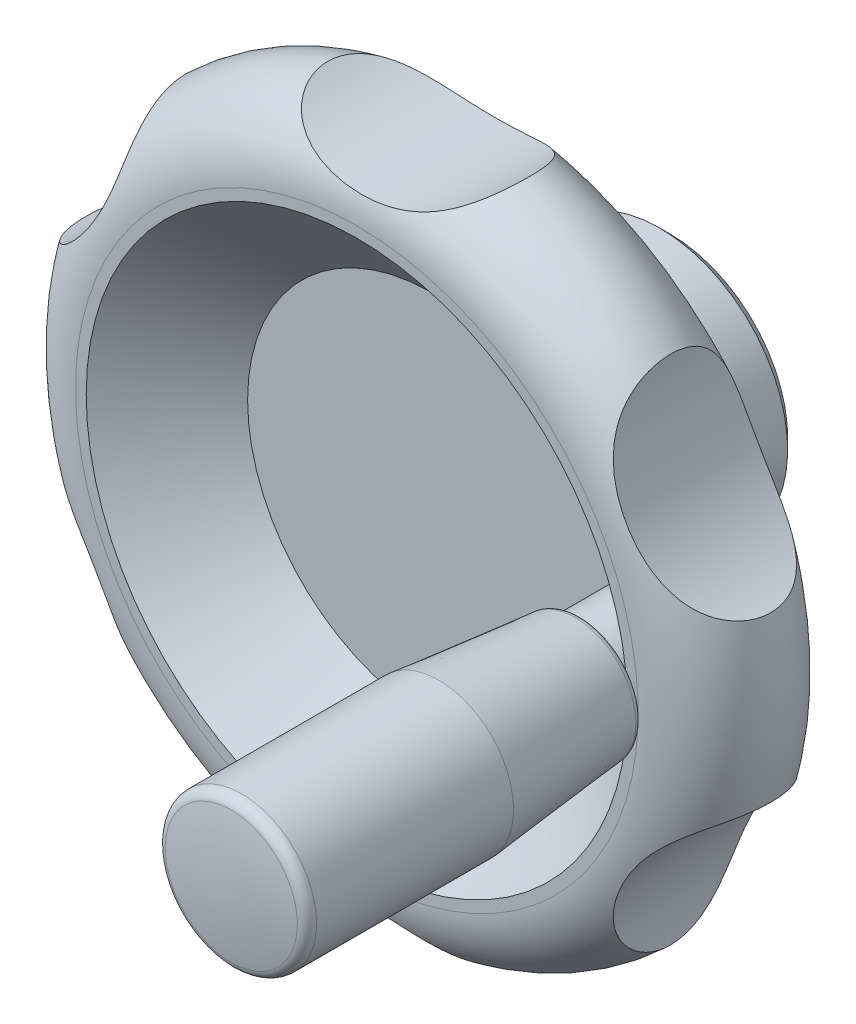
ISO-10303-21;
HEADER;
FILE_DESCRIPTION(('STEP AP214'),'2;1');
FILE_NAME('part.step','',(''),(''),'','','');
FILE_SCHEMA(('AUTOMOTIVE_DESIGN { 1 0 10303 214 1 1 1 1 }'));
ENDSEC;
DATA;
#1=APPLICATION_CONTEXT('core data for automotive mechanical design processes');
#2=APPLICATION_PROTOCOL_DEFINITION('international standard','automotive_design',2000,#1);
#3=PRODUCT_CONTEXT('',#1,'mechanical');
#4=PRODUCT('Part','Part','',(#3));
#5=PRODUCT_RELATED_PRODUCT_CATEGORY('part','',(#4));
#6=PRODUCT_DEFINITION_FORMATION('','',#4);
#7=PRODUCT_DEFINITION_CONTEXT('part definition',#1,'design');
#8=PRODUCT_DEFINITION('design','',#6,#7);
#9=PRODUCT_DEFINITION_SHAPE('','',#8);
#10=(LENGTH_UNIT() NAMED_UNIT(*) SI_UNIT(.MILLI.,.METRE.));
#11=(NAMED_UNIT(*) PLANE_ANGLE_UNIT() SI_UNIT($,.RADIAN.));
#12=(NAMED_UNIT(*) SI_UNIT($,.STERADIAN.) SOLID_ANGLE_UNIT());
#13=UNCERTAINTY_MEASURE_WITH_UNIT(LENGTH_MEASURE(1.E-05),#10,'distance_accuracy_value','');
#14=(GEOMETRIC_REPRESENTATION_CONTEXT(3) GLOBAL_UNCERTAINTY_ASSIGNED_CONTEXT((#13)) GLOBAL_UNIT_ASSIGNED_CONTEXT((#10,
#11,#12)) REPRESENTATION_CONTEXT('',''));
#15=CARTESIAN_POINT('',(0.,0.,0.));
#16=DIRECTION('',(0.,0.,1.));
#17=DIRECTION('',(1.,0.,0.));
#18=AXIS2_PLACEMENT_3D('',#15,#16,#17);
#19=CARTESIAN_POINT('',(0.,0.,34.));
#20=DIRECTION('',(0.,0.,-1.));
#21=DIRECTION('',(0.,1.,0.));
#22=AXIS2_PLACEMENT_3D('',#19,#20,#21);
#23=TOROIDAL_SURFACE('',#22,39.5,10.);
#24=CARTESIAN_POINT('',(40.3422206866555,-17.2540902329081,42.9911719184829));
#25=CARTESIAN_POINT('',(40.6250008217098,-16.9435699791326,42.9240510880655));
#26=CARTESIAN_POINT('',(40.9146524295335,-16.6415640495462,42.8457146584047));
#27=CARTESIAN_POINT('',(41.5048333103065,-16.0565991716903,42.6618807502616));
#28=CARTESIAN_POINT('',(41.8053687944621,-15.7736513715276,42.5563675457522));
#29=CARTESIAN_POINT('',(42.4126910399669,-15.2295980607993,42.3130939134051));
#30=CARTESIAN_POINT('',(42.7194713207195,-14.9684712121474,42.1753655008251));
#31=CARTESIAN_POINT('',(43.333583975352,-14.4705605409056,41.8624943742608));
#32=CARTESIAN_POINT('',(43.6409156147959,-14.2337552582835,41.6873850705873));
#33=CARTESIAN_POINT('',(44.1298947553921,-13.8742524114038,41.3720140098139));
#34=CARTESIAN_POINT('',(44.3138017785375,-13.743078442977,41.2448066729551));
#35=CARTESIAN_POINT('',(44.6768860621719,-13.491297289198,40.9742612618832));
#36=CARTESIAN_POINT('',(44.8560647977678,-13.3706867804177,40.8309282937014));
#37=CARTESIAN_POINT('',(45.207344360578,-13.1405780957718,40.5278564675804));
#38=CARTESIAN_POINT('',(45.3794495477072,-13.0310730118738,40.3681279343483));
#39=CARTESIAN_POINT('',(45.7142969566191,-12.8234714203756,40.0322302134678));
#40=CARTESIAN_POINT('',(45.877038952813,-12.7253751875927,39.8560606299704));
#41=CARTESIAN_POINT('',(46.1918214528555,-12.5401911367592,39.4864400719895));
#42=CARTESIAN_POINT('',(46.3437767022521,-12.4531874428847,39.2928740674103));
#43=CARTESIAN_POINT('',(46.6332355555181,-12.2911354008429,38.8904952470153));
#44=CARTESIAN_POINT('',(46.7707388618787,-12.216087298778,38.6816821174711));
#45=CARTESIAN_POINT('',(47.0290003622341,-12.0779256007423,38.2501918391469));
#46=CARTESIAN_POINT('',(47.1497584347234,-12.0148120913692,38.0275145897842));
#47=CARTESIAN_POINT('',(47.3724847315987,-11.9003881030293,37.5700638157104));
#48=CARTESIAN_POINT('',(47.4744548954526,-11.8490764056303,37.3352915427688));
#49=CARTESIAN_POINT('',(47.6482867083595,-11.7628154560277,36.8808583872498));
#50=CARTESIAN_POINT('',(47.7221835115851,-11.7267151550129,36.6621912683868));
#51=CARTESIAN_POINT('',(47.8525776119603,-11.663634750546,36.2184529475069));
#52=CARTESIAN_POINT('',(47.9090761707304,-11.6366539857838,35.993382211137));
#53=CARTESIAN_POINT('',(48.0039220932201,-11.5916633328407,35.5386278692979));
#54=CARTESIAN_POINT('',(48.0422739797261,-11.5736512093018,35.3089454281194));
#55=CARTESIAN_POINT('',(48.1003507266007,-11.5464697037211,34.846719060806));
#56=CARTESIAN_POINT('',(48.1200759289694,-11.5373001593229,34.6141751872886));
#57=CARTESIAN_POINT('',(48.1401428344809,-11.5279737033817,34.1595323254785));
#58=CARTESIAN_POINT('',(48.1413889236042,-11.5273962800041,33.9374812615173));
#59=CARTESIAN_POINT('',(48.1268000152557,-11.5341739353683,33.4940688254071));
#60=CARTESIAN_POINT('',(48.1109657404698,-11.5415286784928,33.2727074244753));
#61=CARTESIAN_POINT('',(48.0624039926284,-11.5642158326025,32.8322940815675));
#62=CARTESIAN_POINT('',(48.0296790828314,-11.5795470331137,32.6132417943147));
#63=CARTESIAN_POINT('',(47.9477198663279,-11.618278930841,32.1789725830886));
#64=CARTESIAN_POINT('',(47.8984854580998,-11.6416796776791,31.9637556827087));
#65=CARTESIAN_POINT('',(47.7843674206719,-11.6965425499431,31.5397029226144));
#66=CARTESIAN_POINT('',(47.7195608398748,-11.7279650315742,31.3308411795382));
#67=CARTESIAN_POINT('',(47.5749448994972,-11.7990644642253,30.9198313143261));
#68=CARTESIAN_POINT('',(47.4951357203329,-11.8387413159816,30.7176831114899));
#69=CARTESIAN_POINT('',(47.321479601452,-11.9264807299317,30.3214239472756));
#70=CARTESIAN_POINT('',(47.2276339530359,-11.9745425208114,30.1273122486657));
#71=CARTESIAN_POINT('',(47.0270319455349,-12.0791638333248,29.748273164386));
#72=CARTESIAN_POINT('',(46.9202753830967,-12.1357234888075,29.5633459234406));
#73=CARTESIAN_POINT('',(46.6925595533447,-12.2587977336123,29.199556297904));
#74=CARTESIAN_POINT('',(46.5713311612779,-12.3255105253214,29.0209295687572));
#75=CARTESIAN_POINT('',(46.3182196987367,-12.4678944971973,28.6751816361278));
#76=CARTESIAN_POINT('',(46.1863365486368,-12.5435657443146,28.5080605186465));
#77=CARTESIAN_POINT('',(45.9134958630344,-12.7037964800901,28.1859106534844));
#78=CARTESIAN_POINT('',(45.7725373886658,-12.7883568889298,28.0308831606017));
#79=CARTESIAN_POINT('',(45.4831744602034,-12.9662059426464,27.7332714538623));
#80=CARTESIAN_POINT('',(45.334769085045,-13.0594956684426,27.5906887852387));
#81=CARTESIAN_POINT('',(45.0192464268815,-13.2628676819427,27.3064683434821));
#82=CARTESIAN_POINT('',(44.8516118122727,-13.3737034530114,27.1659447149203));
#83=CARTESIAN_POINT('',(44.5114631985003,-13.6049692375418,26.8994953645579));
#84=CARTESIAN_POINT('',(44.3389490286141,-13.7253995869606,26.7735701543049));
#85=CARTESIAN_POINT('',(43.9908424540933,-13.975409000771,26.5358285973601));
#86=CARTESIAN_POINT('',(43.8152496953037,-14.1049891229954,26.4240138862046));
#87=CARTESIAN_POINT('',(43.4626152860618,-14.3727952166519,26.2137974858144));
#88=CARTESIAN_POINT('',(43.2855733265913,-14.5110230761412,26.1153987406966));
#89=CARTESIAN_POINT('',(42.8201652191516,-14.885087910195,25.8732579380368));
#90=CARTESIAN_POINT('',(42.5317727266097,-15.1276656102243,25.739891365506));
#91=CARTESIAN_POINT('',(41.9599778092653,-15.6322373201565,25.5023077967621));
#92=CARTESIAN_POINT('',(41.6765781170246,-15.8942415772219,25.398106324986));
#93=CARTESIAN_POINT('',(41.1176757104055,-16.4364272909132,25.2142738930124));
#94=CARTESIAN_POINT('',(40.8422001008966,-16.7166624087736,25.1347198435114));
#95=CARTESIAN_POINT('',(40.3027358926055,-17.2928184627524,24.9965446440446));
#96=CARTESIAN_POINT('',(40.0387470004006,-17.5887389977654,24.9379229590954));
#97=CARTESIAN_POINT('',(39.5981414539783,-18.1076057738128,24.8524755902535));
#98=CARTESIAN_POINT('',(39.4182234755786,-18.327075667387,24.8213539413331));
#99=CARTESIAN_POINT('',(39.0656611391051,-18.7727585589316,24.7669338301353));
#100=CARTESIAN_POINT('',(38.8930173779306,-18.9989721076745,24.7436360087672));
#101=CARTESIAN_POINT('',(38.5553787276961,-19.4577646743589,24.7040252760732));
#102=CARTESIAN_POINT('',(38.3903869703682,-19.690346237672,24.6877152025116));
#103=CARTESIAN_POINT('',(38.0684723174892,-20.161367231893,24.6614799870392));
#104=CARTESIAN_POINT('',(37.9115492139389,-20.3998065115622,24.6515546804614));
#105=CARTESIAN_POINT('',(37.6059942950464,-20.8822488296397,24.6376977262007));
#106=CARTESIAN_POINT('',(37.4573659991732,-21.1262541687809,24.6337686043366));
#107=CARTESIAN_POINT('',(37.1687230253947,-21.6193354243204,24.6317557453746));
#108=CARTESIAN_POINT('',(37.0287084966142,-21.8684114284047,24.6336721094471));
#109=CARTESIAN_POINT('',(36.7575643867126,-22.371142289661,24.6434242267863));
#110=CARTESIAN_POINT('',(36.626431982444,-22.6247956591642,24.6512580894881));
#111=CARTESIAN_POINT('',(36.3732215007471,-23.1362927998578,24.6731557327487));
#112=CARTESIAN_POINT('',(36.2511430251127,-23.3941363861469,24.687219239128));
#113=CARTESIAN_POINT('',(35.9471495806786,-24.0662893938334,24.7323477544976));
#114=CARTESIAN_POINT('',(35.7722486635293,-24.4834703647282,24.7685472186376));
#115=CARTESIAN_POINT('',(35.446450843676,-25.3249596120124,24.8612285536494));
#116=CARTESIAN_POINT('',(35.2955554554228,-25.7492683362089,24.9177117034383));
#117=CARTESIAN_POINT('',(35.0187116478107,-26.6008780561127,25.055391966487));
#118=CARTESIAN_POINT('',(34.8927017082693,-27.0281688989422,25.1365268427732));
#119=CARTESIAN_POINT('',(34.6655916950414,-27.8825068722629,25.3291668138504));
#120=CARTESIAN_POINT('',(34.564479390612,-28.3095540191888,25.4406569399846));
#121=CARTESIAN_POINT('',(34.416715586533,-29.0158868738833,25.6568335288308));
#122=CARTESIAN_POINT('',(34.3631561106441,-29.2968616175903,25.7513434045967));
#123=CARTESIAN_POINT('',(34.2668296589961,-29.8539431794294,25.9584204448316));
#124=CARTESIAN_POINT('',(34.2240596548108,-30.1300513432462,26.0709825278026));
#125=CARTESIAN_POINT('',(34.1489473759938,-30.6746230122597,26.3157635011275));
#126=CARTESIAN_POINT('',(34.1165959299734,-30.9430930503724,26.4479649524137));
#127=CARTESIAN_POINT('',(34.0616348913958,-31.4696278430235,26.7334833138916));
#128=CARTESIAN_POINT('',(34.0390236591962,-31.7276943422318,26.8867966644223));
#129=CARTESIAN_POINT('',(34.0056657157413,-32.1878945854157,27.1878236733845));
#130=CARTESIAN_POINT('',(33.9935643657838,-32.3921443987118,27.3321554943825));
#131=CARTESIAN_POINT('',(33.9747601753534,-32.7890844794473,27.6362183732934));
#132=CARTESIAN_POINT('',(33.9680562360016,-32.9817770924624,27.7959462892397));
#133=CARTESIAN_POINT('',(33.9592162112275,-33.3535701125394,28.1306483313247));
#134=CARTESIAN_POINT('',(33.9570800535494,-33.5326707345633,28.3056222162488));
#135=CARTESIAN_POINT('',(33.9564359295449,-33.8752734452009,28.6702670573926));
#136=CARTESIAN_POINT('',(33.9579280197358,-34.0387752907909,28.8599382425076));
#137=CARTESIAN_POINT('',(33.9635462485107,-34.3490998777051,29.2540649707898));
#138=CARTESIAN_POINT('',(33.9676861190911,-34.4958309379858,29.4585926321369));
#139=CARTESIAN_POINT('',(33.9775683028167,-34.7699064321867,29.8802358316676));
#140=CARTESIAN_POINT('',(33.9833106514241,-34.8972504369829,30.0973516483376));
#141=CARTESIAN_POINT('',(33.9953910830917,-35.1310726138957,30.5425191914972));
#142=CARTESIAN_POINT('',(34.0017291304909,-35.2375520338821,30.7705702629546));
#143=CARTESIAN_POINT('',(34.0140889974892,-35.4284550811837,31.2357262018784));
#144=CARTESIAN_POINT('',(34.0201108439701,-35.5128805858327,31.4728302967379));
#145=CARTESIAN_POINT('',(34.0305610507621,-35.6519477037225,31.9315044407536));
#146=CARTESIAN_POINT('',(34.0350857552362,-35.7086359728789,32.1524542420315));
#147=CARTESIAN_POINT('',(34.0428089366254,-35.8026654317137,32.5984522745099));
#148=CARTESIAN_POINT('',(34.0460074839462,-35.8400076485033,32.8235002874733));
#149=CARTESIAN_POINT('',(34.050780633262,-35.8950275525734,33.2759513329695));
#150=CARTESIAN_POINT('',(34.0523556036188,-35.9127097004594,33.5033538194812));
#151=CARTESIAN_POINT('',(34.0537403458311,-35.9282798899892,33.9588424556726));
#152=CARTESIAN_POINT('',(34.0535501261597,-35.926168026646,34.1869286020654));
#153=CARTESIAN_POINT('',(34.0514545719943,-35.9025347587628,34.6351039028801));
#154=CARTESIAN_POINT('',(34.0496017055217,-35.8816070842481,34.8552248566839));
#155=CARTESIAN_POINT('',(34.0444121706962,-35.8213272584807,35.2929060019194));
#156=CARTESIAN_POINT('',(34.0410755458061,-35.7819756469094,35.5104662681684));
#157=CARTESIAN_POINT('',(34.0332119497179,-35.6851652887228,35.9414633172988));
#158=CARTESIAN_POINT('',(34.0286851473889,-35.6277091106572,36.154900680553));
#159=CARTESIAN_POINT('',(34.0188578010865,-35.4951530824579,36.5762047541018));
#160=CARTESIAN_POINT('',(34.0135572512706,-35.4200530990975,36.7840714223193));
#161=CARTESIAN_POINT('',(34.0026940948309,-35.252637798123,37.1933208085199));
#162=CARTESIAN_POINT('',(33.9971308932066,-35.1602818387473,37.3946868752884));
#163=CARTESIAN_POINT('',(33.9863698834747,-34.9592742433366,37.789115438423));
#164=CARTESIAN_POINT('',(33.9811720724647,-34.8506227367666,37.9821780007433));
#165=CARTESIAN_POINT('',(33.9718187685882,-34.6179923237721,38.3588475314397));
#166=CARTESIAN_POINT('',(33.9676632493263,-34.4940138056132,38.5424547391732));
#167=CARTESIAN_POINT('',(33.9611026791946,-34.231846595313,38.8992526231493));
#168=CARTESIAN_POINT('',(33.9586976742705,-34.0936575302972,39.0724430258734));
#169=CARTESIAN_POINT('',(33.9563056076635,-33.7990937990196,39.4137006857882));
#170=CARTESIAN_POINT('',(33.9564090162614,-33.6422425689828,39.5813569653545));
#171=CARTESIAN_POINT('',(33.9600139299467,-33.3161416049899,39.9040753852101));
#172=CARTESIAN_POINT('',(33.9635154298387,-33.1468918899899,40.0591375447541));
#173=CARTESIAN_POINT('',(33.9746118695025,-32.7975460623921,40.3563748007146));
#174=CARTESIAN_POINT('',(33.9822072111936,-32.6174488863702,40.4985486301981));
#175=CARTESIAN_POINT('',(34.0020991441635,-32.2479909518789,40.7699688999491));
#176=CARTESIAN_POINT('',(34.0143967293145,-32.0586282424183,40.8992125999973));
#177=CARTESIAN_POINT('',(34.0501573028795,-31.5951713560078,41.1939290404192));
#178=CARTESIAN_POINT('',(34.0761167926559,-31.3173815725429,41.3533162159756));
#179=CARTESIAN_POINT('',(34.1393217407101,-30.7507057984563,41.648357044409));
#180=CARTESIAN_POINT('',(34.1765709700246,-30.4618161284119,41.7840027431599));
#181=CARTESIAN_POINT('',(34.2631190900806,-29.8760205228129,42.0335421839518));
#182=CARTESIAN_POINT('',(34.3124379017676,-29.5791020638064,42.1473994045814));
#183=CARTESIAN_POINT('',(34.4234882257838,-28.980642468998,42.3552481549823));
#184=CARTESIAN_POINT('',(34.4852236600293,-28.6790999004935,42.4492333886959));
#185=CARTESIAN_POINT('',(34.653398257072,-27.9310427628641,42.6598068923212));
#186=CARTESIAN_POINT('',(34.7671845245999,-27.4832739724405,42.7661283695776));
#187=CARTESIAN_POINT('',(35.0219450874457,-26.589129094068,42.9476405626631));
#188=CARTESIAN_POINT('',(35.1629335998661,-26.1427538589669,43.0228149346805));
#189=CARTESIAN_POINT('',(35.4718617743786,-25.2548232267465,43.1481905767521));
#190=CARTESIAN_POINT('',(35.639860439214,-24.8132806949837,43.1983361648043));
#191=CARTESIAN_POINT('',(36.0018334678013,-23.9391873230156,43.2781138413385));
#192=CARTESIAN_POINT('',(36.1958034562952,-23.5066349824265,43.3077493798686));
#193=CARTESIAN_POINT('',(36.5107076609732,-22.8557449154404,43.3396193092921));
#194=CARTESIAN_POINT('',(36.6225659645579,-22.6332559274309,43.3481827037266));
#195=CARTESIAN_POINT('',(36.8530678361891,-22.1916938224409,43.360727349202));
#196=CARTESIAN_POINT('',(36.9717109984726,-21.9726205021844,43.364708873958));
#197=CARTESIAN_POINT('',(37.2156736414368,-21.5381091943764,43.3682170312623));
#198=CARTESIAN_POINT('',(37.3409950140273,-21.3226722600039,43.3677423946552));
#199=CARTESIAN_POINT('',(37.5981181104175,-20.8957778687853,43.3623195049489));
#200=CARTESIAN_POINT('',(37.7299193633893,-20.6843201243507,43.357371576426));
#201=CARTESIAN_POINT('',(37.9993928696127,-20.2663204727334,43.342877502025));
#202=CARTESIAN_POINT('',(38.1370444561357,-20.0597647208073,43.3333464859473));
#203=CARTESIAN_POINT('',(38.4184126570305,-19.6511355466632,43.3094137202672));
#204=CARTESIAN_POINT('',(38.5621287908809,-19.4490617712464,43.2950123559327));
#205=CARTESIAN_POINT('',(38.8553351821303,-19.0497536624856,43.260938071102));
#206=CARTESIAN_POINT('',(39.0048225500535,-18.8525169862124,43.2412677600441));
#207=CARTESIAN_POINT('',(39.3093544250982,-18.4630879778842,43.1961210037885));
#208=CARTESIAN_POINT('',(39.4643983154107,-18.2708950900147,43.1706452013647));
#209=CARTESIAN_POINT('',(39.7392249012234,-17.9405364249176,43.1206066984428));
#210=CARTESIAN_POINT('',(39.8578346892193,-17.8011743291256,43.0974904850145));
#211=CARTESIAN_POINT('',(40.0979357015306,-17.5253671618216,43.0473483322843));
#212=CARTESIAN_POINT('',(40.2194303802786,-17.3889260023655,43.020317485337));
#213=CARTESIAN_POINT('',(40.3422206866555,-17.2540902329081,42.9911719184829));
#214=B_SPLINE_CURVE_WITH_KNOTS('',3,(#24,#25,#26,#27,#28,#29,#30,#31,#32,#33,#34,#35,#36,#37,
#38,#39,#40,#41,#42,#43,#44,#45,#46,#47,#48,#49,#50,#51,#52,#53,#54,#55,#56,#57,#58,#59,#60,#61,
#62,#63,#64,#65,#66,#67,#68,#69,#70,#71,#72,#73,#74,#75,#76,#77,#78,#79,#80,#81,#82,#83,#84,#85,
#86,#87,#88,#89,#90,#91,#92,#93,#94,#95,#96,#97,#98,#99,#100,#101,#102,#103,#104,#105,#106,#107,
#108,#109,#110,#111,#112,#113,#114,#115,#116,#117,#118,#119,#120,#121,#122,#123,#124,#125,#126,
#127,#128,#129,#130,#131,#132,#133,#134,#135,#136,#137,#138,#139,#140,#141,#142,#143,#144,#145,
#146,#147,#148,#149,#150,#151,#152,#153,#154,#155,#156,#157,#158,#159,#160,#161,#162,#163,#164,
#165,#166,#167,#168,#169,#170,#171,#172,#173,#174,#175,#176,#177,#178,#179,#180,#181,#182,#183,
#184,#185,#186,#187,#188,#189,#190,#191,#192,#193,#194,#195,#196,#197,#198,#199,#200,#201,#202,
#203,#204,#205,#206,#207,#208,#209,#210,#211,#212,#213),.UNSPECIFIED.,.T.,.F.,(4,2,2,2,2,2,2,2,
2,2,2,2,2,2,2,2,2,2,2,2,2,2,2,2,2,2,2,2,2,2,2,2,2,2,2,2,2,2,2,2,2,2,2,2,2,2,2,2,2,2,2,2,2,2,2,2,
2,2,2,2,2,2,2,2,2,2,2,2,2,2,2,2,2,2,2,2,2,2,2,2,2,2,2,2,2,2,2,2,2,2,2,2,2,2,4),(0.,
1.27580066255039,2.55234124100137,3.82761855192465,5.10176078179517,5.87885183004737,
6.65569750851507,7.4320569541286,8.20843509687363,8.99038930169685,9.77235960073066,
10.5543355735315,11.3362307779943,12.0362080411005,12.7361345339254,13.4358864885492,
14.1356255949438,14.8009990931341,15.4663444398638,16.1315888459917,16.7968373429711,
17.4588597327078,18.1208741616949,18.7828277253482,19.4447917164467,20.121905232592,
20.7990238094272,21.4762125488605,22.1534852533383,22.8884247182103,23.6233899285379,
24.3584402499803,25.0936516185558,26.2909906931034,27.4889658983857,28.6906425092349,
29.8922884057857,30.7485009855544,31.6047836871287,32.4614138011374,33.3180218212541,
34.1749905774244,35.0319741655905,35.8886840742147,36.7453562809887,38.1056495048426,
39.4660285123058,40.8230011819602,42.1793059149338,43.0823720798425,43.9851844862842,
44.8871999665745,45.789063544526,46.5395030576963,47.2897897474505,48.0400645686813,
48.790351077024,49.5445606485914,50.2987869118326,51.052968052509,51.80708497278,
52.4906956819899,53.174270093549,53.8576893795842,54.5411053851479,55.2036850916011,
55.8662453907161,56.5287117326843,57.191183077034,57.8552348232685,58.5192812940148,
59.1833109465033,59.8473580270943,60.5353895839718,61.2234200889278,61.9115181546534,
62.5997617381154,63.5622564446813,64.5250730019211,65.4894895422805,66.4542111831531,
67.8742379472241,69.2950089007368,70.7189267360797,72.1426049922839,72.8899922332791,
73.6373348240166,74.3848902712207,75.1323914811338,75.8774417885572,76.6224331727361,
77.3670562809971,78.1115969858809,78.6648822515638,79.2188672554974),.UNSPECIFIED.);
#215=CARTESIAN_POINT('',(40.3422206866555,-17.2540902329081,42.9911719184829));
#216=VERTEX_POINT('',#215);
#217=EDGE_CURVE('E91',#216,#216,#214,.T.);
#218=ORIENTED_EDGE('',*,*,#217,.T.);
#219=EDGE_LOOP('',(#218));
#220=FACE_BOUND('',#219,.T.);
#221=CARTESIAN_POINT('',(-44.0616334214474,-13.9249745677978,41.414883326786));
#222=CARTESIAN_POINT('',(-43.7576449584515,-14.1457124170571,41.6169796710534));
#223=CARTESIAN_POINT('',(-43.4493890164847,-14.3802851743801,41.797937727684));
#224=CARTESIAN_POINT('',(-42.8325390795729,-14.8743082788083,42.1215972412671));
#225=CARTESIAN_POINT('',(-42.5239451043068,-15.133786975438,42.2642543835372));
#226=CARTESIAN_POINT('',(-41.9110546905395,-15.6762742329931,42.5170364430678));
#227=CARTESIAN_POINT('',(-41.6067912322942,-15.9594043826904,42.6269780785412));
#228=CARTESIAN_POINT('',(-41.0088456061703,-16.5454328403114,42.8186360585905));
#229=CARTESIAN_POINT('',(-40.7151615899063,-16.8483276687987,42.900357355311));
#230=CARTESIAN_POINT('',(-40.2455694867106,-17.3586256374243,43.0150811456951));
#231=CARTESIAN_POINT('',(-40.0655893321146,-17.5608033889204,43.0550022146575));
#232=CARTESIAN_POINT('',(-39.711722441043,-17.9718889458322,43.1264979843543));
#233=CARTESIAN_POINT('',(-39.53783611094,-18.1807971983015,43.1580721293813));
#234=CARTESIAN_POINT('',(-39.1966133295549,-18.6049474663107,43.2138315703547));
#235=CARTESIAN_POINT('',(-39.0292789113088,-18.8201914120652,43.2380145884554));
#236=CARTESIAN_POINT('',(-38.7016033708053,-19.2565526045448,43.2797597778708));
#237=CARTESIAN_POINT('',(-38.5412621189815,-19.4776697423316,43.2973220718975));
#238=CARTESIAN_POINT('',(-38.2277569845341,-19.9255988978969,43.3264377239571));
#239=CARTESIAN_POINT('',(-38.0745993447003,-20.1524156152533,43.3379859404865));
#240=CARTESIAN_POINT('',(-37.7758776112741,-20.6112060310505,43.3554610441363));
#241=CARTESIAN_POINT('',(-37.6303135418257,-20.843179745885,43.3613879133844));
#242=CARTESIAN_POINT('',(-37.3470366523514,-21.311894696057,43.3678355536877));
#243=CARTESIAN_POINT('',(-37.2093225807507,-21.5486351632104,43.3683571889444));
#244=CARTESIAN_POINT('',(-36.9419288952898,-22.0265632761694,43.3640156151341));
#245=CARTESIAN_POINT('',(-36.8122493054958,-22.2677509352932,43.3591523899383));
#246=CARTESIAN_POINT('',(-36.5573844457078,-22.7614253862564,43.3436370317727));
#247=CARTESIAN_POINT('',(-36.4324470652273,-23.0140350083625,43.3328172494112));
#248=CARTESIAN_POINT('',(-36.19148400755,-23.523132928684,43.3048712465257));
#249=CARTESIAN_POINT('',(-36.075458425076,-23.7796212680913,43.2877449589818));
#250=CARTESIAN_POINT('',(-35.8524547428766,-24.2960815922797,43.2465529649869));
#251=CARTESIAN_POINT('',(-35.7454803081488,-24.5560549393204,43.2224844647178));
#252=CARTESIAN_POINT('',(-35.5408002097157,-25.0788037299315,43.1665786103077));
#253=CARTESIAN_POINT('',(-35.443094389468,-25.3415791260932,43.1347413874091));
#254=CARTESIAN_POINT('',(-35.257483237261,-25.8681685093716,43.0624184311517));
#255=CARTESIAN_POINT('',(-35.1695392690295,-26.1319737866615,43.0219687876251));
#256=CARTESIAN_POINT('',(-35.0031134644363,-26.6608923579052,42.9311500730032));
#257=CARTESIAN_POINT('',(-34.9246322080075,-26.9260057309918,42.880780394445));
#258=CARTESIAN_POINT('',(-34.7772980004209,-27.4562835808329,42.7688344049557));
#259=CARTESIAN_POINT('',(-34.7084360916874,-27.7214477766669,42.7072686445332));
#260=CARTESIAN_POINT('',(-34.5803049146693,-28.2508011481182,42.57146661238));
#261=CARTESIAN_POINT('',(-34.5210334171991,-28.5149905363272,42.4972332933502));
#262=CARTESIAN_POINT('',(-34.4095274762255,-29.0530173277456,42.3308587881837));
#263=CARTESIAN_POINT('',(-34.3577385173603,-29.3267437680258,42.2380541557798));
#264=CARTESIAN_POINT('',(-34.2644078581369,-29.8695237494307,42.0352388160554));
#265=CARTESIAN_POINT('',(-34.2228646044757,-30.1385779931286,41.9252307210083));
#266=CARTESIAN_POINT('',(-34.1496650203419,-30.669558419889,41.6864668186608));
#267=CARTESIAN_POINT('',(-34.1180052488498,-30.9314870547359,41.5577175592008));
#268=CARTESIAN_POINT('',(-34.0639641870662,-31.4455451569,41.2801453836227));
#269=CARTESIAN_POINT('',(-34.0415831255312,-31.6976743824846,41.1313219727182));
#270=CARTESIAN_POINT('',(-34.0050399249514,-32.1918915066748,40.8108912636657));
#271=CARTESIAN_POINT('',(-33.9909759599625,-32.433829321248,40.6390400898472));
#272=CARTESIAN_POINT('',(-33.9703080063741,-32.9011195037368,40.2736120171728));
#273=CARTESIAN_POINT('',(-33.9637041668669,-33.1264715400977,40.0800346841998));
#274=CARTESIAN_POINT('',(-33.9565289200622,-33.5570089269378,39.6717105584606));
#275=CARTESIAN_POINT('',(-33.9559538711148,-33.7622063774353,39.456976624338));
#276=CARTESIAN_POINT('',(-33.959203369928,-34.1492721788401,39.0074521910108));
#277=CARTESIAN_POINT('',(-33.9630270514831,-34.3311451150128,38.7726656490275));
#278=CARTESIAN_POINT('',(-33.9725966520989,-34.6436941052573,38.32101009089));
#279=CARTESIAN_POINT('',(-33.9779754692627,-34.7779645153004,38.1066127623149));
#280=CARTESIAN_POINT('',(-33.9896435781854,-35.0258666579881,37.6662224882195));
#281=CARTESIAN_POINT('',(-33.99593278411,-35.1395003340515,37.4402306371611));
#282=CARTESIAN_POINT('',(-34.0084593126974,-35.3448017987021,36.9785591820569));
#283=CARTESIAN_POINT('',(-34.0146966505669,-35.4364762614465,36.7428825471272));
#284=CARTESIAN_POINT('',(-34.0262936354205,-35.5968910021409,36.2638302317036));
#285=CARTESIAN_POINT('',(-34.0316533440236,-35.6656328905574,36.0204550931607));
#286=CARTESIAN_POINT('',(-34.0403586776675,-35.7733996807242,35.554417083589));
#287=CARTESIAN_POINT('',(-34.0438578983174,-35.8148077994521,35.3323047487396));
#288=CARTESIAN_POINT('',(-34.0493192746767,-35.8783964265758,34.8853294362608));
#289=CARTESIAN_POINT('',(-34.0512815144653,-35.9005779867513,34.6604666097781));
#290=CARTESIAN_POINT('',(-34.0534932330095,-35.9255311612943,34.2097225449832));
#291=CARTESIAN_POINT('',(-34.0537431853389,-35.9283081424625,33.9838416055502));
#292=CARTESIAN_POINT('',(-34.0525096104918,-35.9144445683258,33.5326781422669));
#293=CARTESIAN_POINT('',(-34.051026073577,-35.897803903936,33.3073956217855));
#294=CARTESIAN_POINT('',(-34.046508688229,-35.8458290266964,32.8641365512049));
#295=CARTESIAN_POINT('',(-34.04351032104,-35.8109220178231,32.6461094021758));
#296=CARTESIAN_POINT('',(-34.0362439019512,-35.7229542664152,32.2137761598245));
#297=CARTESIAN_POINT('',(-34.031975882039,-35.6698939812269,31.9994699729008));
#298=CARTESIAN_POINT('',(-34.0225573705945,-35.5460522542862,31.5760896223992));
#299=CARTESIAN_POINT('',(-34.0174069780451,-35.4752727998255,31.3670148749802));
#300=CARTESIAN_POINT('',(-34.0067216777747,-35.3165749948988,30.9554869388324));
#301=CARTESIAN_POINT('',(-34.0011867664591,-35.2286564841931,30.7530338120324));
#302=CARTESIAN_POINT('',(-33.9902843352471,-35.0357576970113,30.3546724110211));
#303=CARTESIAN_POINT('',(-33.984918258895,-34.9306622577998,30.1588198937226));
#304=CARTESIAN_POINT('',(-33.9750655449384,-34.7047893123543,29.7763644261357));
#305=CARTESIAN_POINT('',(-33.9705789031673,-34.5840118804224,29.5897614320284));
#306=CARTESIAN_POINT('',(-33.9631957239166,-34.3278689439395,29.226827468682));
#307=CARTESIAN_POINT('',(-33.9602991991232,-34.1925033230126,29.0504965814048));
#308=CARTESIAN_POINT('',(-33.9568152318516,-33.9084197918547,28.708925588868));
#309=CARTESIAN_POINT('',(-33.9562278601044,-33.7597014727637,28.5436858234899));
#310=CARTESIAN_POINT('',(-33.9581028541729,-33.443030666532,28.2174463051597));
#311=CARTESIAN_POINT('',(-33.9607088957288,-33.2745043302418,28.0570047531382));
#312=CARTESIAN_POINT('',(-33.9699570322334,-32.9259296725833,27.7493276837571));
#313=CARTESIAN_POINT('',(-33.9765991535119,-32.745881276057,27.6020922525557));
#314=CARTESIAN_POINT('',(-33.9945781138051,-32.3758955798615,27.3209214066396));
#315=CARTESIAN_POINT('',(-34.0059154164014,-32.1859573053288,27.1869873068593));
#316=CARTESIAN_POINT('',(-34.0338388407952,-31.7978135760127,26.9322601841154));
#317=CARTESIAN_POINT('',(-34.0504261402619,-31.5996062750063,26.8114701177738));
#318=CARTESIAN_POINT('',(-34.0981995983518,-31.1043135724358,26.530356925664));
#319=CARTESIAN_POINT('',(-34.1325931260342,-30.8034462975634,26.3772027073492));
#320=CARTESIAN_POINT('',(-34.2145022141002,-30.191848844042,26.0961726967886));
#321=CARTESIAN_POINT('',(-34.2620228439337,-29.8811148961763,25.9683067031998));
#322=CARTESIAN_POINT('',(-34.3708588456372,-29.2529600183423,25.7352444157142));
#323=CARTESIAN_POINT('',(-34.4322017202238,-28.93552691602,25.6300941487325));
#324=CARTESIAN_POINT('',(-34.5689080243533,-28.2975546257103,25.4400998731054));
#325=CARTESIAN_POINT('',(-34.6442759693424,-27.9770144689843,25.3552624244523));
#326=CARTESIAN_POINT('',(-34.7878304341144,-27.4179794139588,25.2228463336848));
#327=CARTESIAN_POINT('',(-34.8528748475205,-27.1795958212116,25.1712975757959));
#328=CARTESIAN_POINT('',(-34.9906586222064,-26.7033234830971,25.0769320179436));
#329=CARTESIAN_POINT('',(-35.063398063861,-26.4654347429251,25.0341153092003));
#330=CARTESIAN_POINT('',(-35.2165353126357,-25.9907280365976,24.9562513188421));
#331=CARTESIAN_POINT('',(-35.2969370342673,-25.7539106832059,24.9212080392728));
#332=CARTESIAN_POINT('',(-35.4652642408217,-25.2820639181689,24.8580764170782));
#333=CARTESIAN_POINT('',(-35.5531889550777,-25.047034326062,24.8299873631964));
#334=CARTESIAN_POINT('',(-35.7366264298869,-24.5787989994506,24.779985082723));
#335=CARTESIAN_POINT('',(-35.8321526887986,-24.3455973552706,24.758083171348));
#336=CARTESIAN_POINT('',(-36.0305272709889,-23.8818842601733,24.7199176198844));
#337=CARTESIAN_POINT('',(-36.1333751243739,-23.651372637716,24.7036536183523));
#338=CARTESIAN_POINT('',(-36.3462578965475,-23.1934166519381,24.6762902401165));
#339=CARTESIAN_POINT('',(-36.4562919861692,-22.9659719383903,24.6651902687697));
#340=CARTESIAN_POINT('',(-36.6834135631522,-22.5144665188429,24.6478179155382));
#341=CARTESIAN_POINT('',(-36.8005005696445,-22.2904055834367,24.6415452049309));
#342=CARTESIAN_POINT('',(-37.04665995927,-21.8366059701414,24.6334650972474));
#343=CARTESIAN_POINT('',(-37.1760293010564,-21.6070247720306,24.6318565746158));
#344=CARTESIAN_POINT('',(-37.4420986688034,-21.1521695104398,24.633613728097));
#345=CARTESIAN_POINT('',(-37.578798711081,-20.9268954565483,24.6369794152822));
#346=CARTESIAN_POINT('',(-37.8593602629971,-20.4809230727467,24.648800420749));
#347=CARTESIAN_POINT('',(-38.0032232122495,-20.2602256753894,24.6572567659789));
#348=CARTESIAN_POINT('',(-38.2978624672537,-19.8237657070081,24.6795419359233));
#349=CARTESIAN_POINT('',(-38.448638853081,-19.6080031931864,24.6933708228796));
#350=CARTESIAN_POINT('',(-38.7565973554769,-19.1820789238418,24.7268215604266));
#351=CARTESIAN_POINT('',(-38.9137688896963,-18.971908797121,24.7464341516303));
#352=CARTESIAN_POINT('',(-39.2344247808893,-18.5571637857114,24.7920640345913));
#353=CARTESIAN_POINT('',(-39.3979088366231,-18.3525886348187,24.8180810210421));
#354=CARTESIAN_POINT('',(-39.7307546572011,-17.9494714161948,24.8772653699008));
#355=CARTESIAN_POINT('',(-39.9001139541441,-17.7509268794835,24.9104297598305));
#356=CARTESIAN_POINT('',(-40.2443027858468,-17.3601907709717,24.9848129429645));
#357=CARTESIAN_POINT('',(-40.4191322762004,-17.1679991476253,25.0260316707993));
#358=CARTESIAN_POINT('',(-40.8285571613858,-16.7319804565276,25.1317068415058));
#359=CARTESIAN_POINT('',(-41.0649119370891,-16.4905700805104,25.1994074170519));
#360=CARTESIAN_POINT('',(-41.54430646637,-16.020558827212,25.3529221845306));
#361=CARTESIAN_POINT('',(-41.7873444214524,-15.7919545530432,25.4387315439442));
#362=CARTESIAN_POINT('',(-42.2775867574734,-15.3490553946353,25.6310990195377));
#363=CARTESIAN_POINT('',(-42.5247845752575,-15.1347402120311,25.7376268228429));
#364=CARTESIAN_POINT('',(-43.0207579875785,-14.721459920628,25.9742595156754));
#365=CARTESIAN_POINT('',(-43.2695332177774,-14.5224913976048,26.1043591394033));
#366=CARTESIAN_POINT('',(-43.7137322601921,-14.180737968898,26.361015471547));
#367=CARTESIAN_POINT('',(-43.9095537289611,-14.0348414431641,26.4827448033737));
#368=CARTESIAN_POINT('',(-44.2976281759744,-13.7543118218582,26.7435832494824));
#369=CARTESIAN_POINT('',(-44.4898820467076,-13.6196758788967,26.8826879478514));
#370=CARTESIAN_POINT('',(-44.8683695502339,-13.3622766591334,27.1789750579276));
#371=CARTESIAN_POINT('',(-45.054603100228,-13.2395135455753,27.3361577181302));
#372=CARTESIAN_POINT('',(-45.4183233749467,-13.0063981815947,27.6688469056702));
#373=CARTESIAN_POINT('',(-45.5958100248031,-12.896046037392,27.8443535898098));
#374=CARTESIAN_POINT('',(-45.940660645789,-12.6872512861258,28.2150231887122));
#375=CARTESIAN_POINT('',(-46.1079240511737,-12.5889196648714,28.4103426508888));
#376=CARTESIAN_POINT('',(-46.4277153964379,-12.4055118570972,28.8185348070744));
#377=CARTESIAN_POINT('',(-46.5802428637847,-12.3204360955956,29.0314080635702));
#378=CARTESIAN_POINT('',(-46.8677086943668,-12.1636209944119,29.4732305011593));
#379=CARTESIAN_POINT('',(-47.0026535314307,-12.0918767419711,29.7021737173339));
#380=CARTESIAN_POINT('',(-47.2524851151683,-11.9615830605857,30.1743050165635));
#381=CARTESIAN_POINT('',(-47.3673749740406,-11.9030315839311,30.4174908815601));
#382=CARTESIAN_POINT('',(-47.5603554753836,-11.8062239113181,30.8807313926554));
#383=CARTESIAN_POINT('',(-47.6413490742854,-11.7662715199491,31.0992291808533));
#384=CARTESIAN_POINT('',(-47.7858525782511,-11.6957674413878,31.5434040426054));
#385=CARTESIAN_POINT('',(-47.8493637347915,-11.6652150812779,31.7690806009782));
#386=CARTESIAN_POINT('',(-47.9580286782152,-11.6133512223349,32.225781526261));
#387=CARTESIAN_POINT('',(-48.0031875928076,-11.5920371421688,32.4568043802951));
#388=CARTESIAN_POINT('',(-48.0745726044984,-11.5584996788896,32.9224099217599));
#389=CARTESIAN_POINT('',(-48.1007990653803,-11.5462761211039,33.1569925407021));
#390=CARTESIAN_POINT('',(-48.1330029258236,-11.5312857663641,33.6139986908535));
#391=CARTESIAN_POINT('',(-48.1400770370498,-11.528006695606,33.8363290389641));
#392=CARTESIAN_POINT('',(-48.1370633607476,-11.5294059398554,34.2808420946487));
#393=CARTESIAN_POINT('',(-48.1269763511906,-11.5340838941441,34.5030248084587));
#394=CARTESIAN_POINT('',(-48.0897617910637,-11.5514256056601,34.9456005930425));
#395=CARTESIAN_POINT('',(-48.0626374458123,-11.5640878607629,35.1659939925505));
#396=CARTESIAN_POINT('',(-47.9916682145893,-11.5974756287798,35.6034534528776));
#397=CARTESIAN_POINT('',(-47.9478232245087,-11.6182011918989,35.8205194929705));
#398=CARTESIAN_POINT('',(-47.8443038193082,-11.6676542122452,36.2482425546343));
#399=CARTESIAN_POINT('',(-47.7847450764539,-11.6963232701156,36.4589343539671));
#400=CARTESIAN_POINT('',(-47.6503608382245,-11.7618600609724,36.8740756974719));
#401=CARTESIAN_POINT('',(-47.5755355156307,-11.7987277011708,37.0785253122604));
#402=CARTESIAN_POINT('',(-47.4115126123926,-11.8807999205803,37.4798366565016));
#403=CARTESIAN_POINT('',(-47.3223152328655,-11.9260043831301,37.6766984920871));
#404=CARTESIAN_POINT('',(-47.1306225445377,-12.0248703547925,38.0616195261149));
#405=CARTESIAN_POINT('',(-47.0281271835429,-12.0785318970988,38.2496786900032));
#406=CARTESIAN_POINT('',(-46.808908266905,-12.1955494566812,38.6195911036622));
#407=CARTESIAN_POINT('',(-46.691941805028,-12.2590774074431,38.8012459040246));
#408=CARTESIAN_POINT('',(-46.4469101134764,-12.3950422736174,39.1533884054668));
#409=CARTESIAN_POINT('',(-46.318844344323,-12.4674796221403,39.3238755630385));
#410=CARTESIAN_POINT('',(-46.0531994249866,-12.6211965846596,39.6529592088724));
#411=CARTESIAN_POINT('',(-45.9156224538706,-12.7024741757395,39.8115584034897));
#412=CARTESIAN_POINT('',(-45.6325754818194,-12.8737255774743,40.116444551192));
#413=CARTESIAN_POINT('',(-45.4871065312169,-12.9636982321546,40.2627331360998));
#414=CARTESIAN_POINT('',(-45.1348038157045,-13.1870552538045,40.5947103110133));
#415=CARTESIAN_POINT('',(-44.9251745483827,-13.3241873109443,40.77495776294));
#416=CARTESIAN_POINT('',(-44.6050037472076,-13.5411711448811,41.0278227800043));
#417=CARTESIAN_POINT('',(-44.4973628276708,-13.615353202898,41.1091690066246));
#418=CARTESIAN_POINT('',(-44.2805446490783,-13.7674135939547,41.2662235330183));
#419=CARTESIAN_POINT('',(-44.171367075,-13.8452926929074,41.3419306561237));
#420=CARTESIAN_POINT('',(-44.0616334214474,-13.9249745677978,41.414883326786));
#421=B_SPLINE_CURVE_WITH_KNOTS('',3,(#221,#222,#223,#224,#225,#226,#227,#228,#229,#230,#231,
#232,#233,#234,#235,#236,#237,#238,#239,#240,#241,#242,#243,#244,#245,#246,#247,#248,#249,#250,
#251,#252,#253,#254,#255,#256,#257,#258,#259,#260,#261,#262,#263,#264,#265,#266,#267,#268,#269,
#270,#271,#272,#273,#274,#275,#276,#277,#278,#279,#280,#281,#282,#283,#284,#285,#286,#287,#288,
#289,#290,#291,#292,#293,#294,#295,#296,#297,#298,#299,#300,#301,#302,#303,#304,#305,#306,#307,
#308,#309,#310,#311,#312,#313,#314,#315,#316,#317,#318,#319,#320,#321,#322,#323,#324,#325,#326,
#327,#328,#329,#330,#331,#332,#333,#334,#335,#336,#337,#338,#339,#340,#341,#342,#343,#344,#345,
#346,#347,#348,#349,#350,#351,#352,#353,#354,#355,#356,#357,#358,#359,#360,#361,#362,#363,#364,
#365,#366,#367,#368,#369,#370,#371,#372,#373,#374,#375,#376,#377,#378,#379,#380,#381,#382,#383,
#384,#385,#386,#387,#388,#389,#390,#391,#392,#393,#394,#395,#396,#397,#398,#399,#400,#401,#402,
#403,#404,#405,#406,#407,#408,#409,#410,#411,#412,#413,#414,#415,#416,#417,#418,#419,#420),
.UNSPECIFIED.,.T.,.F.,(4,2,2,2,2,2,2,2,2,2,2,2,2,2,2,2,2,2,2,2,2,2,2,2,2,2,2,2,2,2,2,2,2,2,2,2,
2,2,2,2,2,2,2,2,2,2,2,2,2,2,2,2,2,2,2,2,2,2,2,2,2,2,2,2,2,2,2,2,2,2,2,2,2,2,2,2,2,2,2,2,2,2,2,2,
2,2,2,2,2,2,2,2,2,2,2,2,2,2,2,4),(0.,1.27951517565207,2.56050444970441,3.84854063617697,
5.13635068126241,5.95692673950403,6.7775574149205,7.59844074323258,8.41930885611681,
9.24087759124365,10.0624489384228,10.8838889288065,11.7053313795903,12.5511719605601,
13.3970215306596,14.2432119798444,15.0893881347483,15.9320858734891,16.7748352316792,
17.6167945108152,18.4585578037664,19.3387966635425,20.2189019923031,21.0987005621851,
21.9785208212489,22.868529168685,23.7585553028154,24.6480437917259,25.5373571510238,
26.2953851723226,27.053341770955,27.8110677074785,28.5687404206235,29.2458191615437,
29.9228608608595,30.599715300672,31.2765735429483,31.9382660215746,32.5999418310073,
33.2615434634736,33.923151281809,34.5893919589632,35.2556294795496,35.9218723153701,
36.588135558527,37.2855072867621,37.9828835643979,38.6803287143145,39.3779304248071,
40.3944210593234,41.4113047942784,42.4302300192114,43.4494838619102,44.206474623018,
44.9634732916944,45.7208607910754,46.4781707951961,47.2368569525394,47.9954944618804,
48.7540445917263,49.5125430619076,50.3029389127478,51.0933365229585,51.8838936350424,
52.6744599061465,53.4637673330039,54.2530371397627,55.0419793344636,55.830915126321,
56.8638832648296,57.8965760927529,58.9277692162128,59.9587322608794,60.7765705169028,
61.5942013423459,62.4118434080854,63.2294924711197,64.0541971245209,64.8789282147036,
65.7033547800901,66.5276532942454,67.236024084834,67.9443441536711,68.6524661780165,
69.3605745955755,70.0271805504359,70.6937562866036,71.360206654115,72.0266611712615,
72.6883403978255,73.3500121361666,74.0116746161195,74.6733396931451,75.3481950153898,
76.0230831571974,76.6978171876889,77.3724616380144,78.2966484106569,78.7584312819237,
79.2203102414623),.UNSPECIFIED.);
#422=CARTESIAN_POINT('',(-44.0616334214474,-13.9249745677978,41.414883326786));
#423=VERTEX_POINT('',#422);
#424=EDGE_CURVE('E123',#423,#423,#421,.T.);
#425=ORIENTED_EDGE('',*,*,#424,.T.);
#426=EDGE_LOOP('',(#425));
#427=FACE_BOUND('',#426,.T.);
#428=CARTESIAN_POINT('',(-11.492352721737,45.8626288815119,40.2819027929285));
#429=CARTESIAN_POINT('',(-11.6511345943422,45.9469637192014,40.1327768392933));
#430=CARTESIAN_POINT('',(-11.8041024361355,46.0304553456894,39.9769342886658));
#431=CARTESIAN_POINT('',(-12.0973324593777,46.1943016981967,39.6520768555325));
#432=CARTESIAN_POINT('',(-12.2375903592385,46.2746553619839,39.4830575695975));
#433=CARTESIAN_POINT('',(-12.5045005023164,46.4307948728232,39.1322756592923));
#434=CARTESIAN_POINT('',(-12.6311380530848,46.5065757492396,38.9504996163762));
#435=CARTESIAN_POINT('',(-12.8697457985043,46.6519983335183,38.5752527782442));
#436=CARTESIAN_POINT('',(-12.9817172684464,46.721640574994,38.3817830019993));
#437=CARTESIAN_POINT('',(-13.1905618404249,46.8535865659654,37.9837134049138));
#438=CARTESIAN_POINT('',(-13.2873922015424,46.9158694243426,37.7790842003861));
#439=CARTESIAN_POINT('',(-13.4649904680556,47.0316029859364,37.3605501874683));
#440=CARTESIAN_POINT('',(-13.5457578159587,47.0850533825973,37.1466450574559));
#441=CARTESIAN_POINT('',(-13.6907622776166,47.1820118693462,36.711161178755));
#442=CARTESIAN_POINT('',(-13.7550025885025,47.2255218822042,36.4895839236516));
#443=CARTESIAN_POINT('',(-13.8666489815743,47.3017173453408,36.0404115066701));
#444=CARTESIAN_POINT('',(-13.9140557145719,47.334403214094,35.8128165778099));
#445=CARTESIAN_POINT('',(-13.9901738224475,47.3871412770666,35.363137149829));
#446=CARTESIAN_POINT('',(-14.0195923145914,47.407670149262,35.1412278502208));
#447=CARTESIAN_POINT('',(-14.0626855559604,47.4378074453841,34.6951528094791));
#448=CARTESIAN_POINT('',(-14.0763607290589,47.4474161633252,34.4709871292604));
#449=CARTESIAN_POINT('',(-14.0879176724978,47.4555337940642,34.022068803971));
#450=CARTESIAN_POINT('',(-14.0858008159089,47.4540436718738,33.7973162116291));
#451=CARTESIAN_POINT('',(-14.0657845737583,47.4399936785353,33.3488626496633));
#452=CARTESIAN_POINT('',(-14.0478852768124,47.4274338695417,33.1251616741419));
#453=CARTESIAN_POINT('',(-13.9968281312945,47.3917989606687,32.684407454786));
#454=CARTESIAN_POINT('',(-13.9639466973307,47.3689144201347,32.4673066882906));
#455=CARTESIAN_POINT('',(-13.8831455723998,47.3131063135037,32.037238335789));
#456=CARTESIAN_POINT('',(-13.8352261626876,47.280182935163,31.8242706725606));
#457=CARTESIAN_POINT('',(-13.7245532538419,47.2048993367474,31.4039677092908));
#458=CARTESIAN_POINT('',(-13.6618018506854,47.1625404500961,31.1966316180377));
#459=CARTESIAN_POINT('',(-13.5217440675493,47.069152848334,30.7889486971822));
#460=CARTESIAN_POINT('',(-13.4444375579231,47.0181240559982,30.5886019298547));
#461=CARTESIAN_POINT('',(-13.2749105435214,46.9078398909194,30.194449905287));
#462=CARTESIAN_POINT('',(-13.1825648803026,46.8485161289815,30.0007176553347));
#463=CARTESIAN_POINT('',(-12.9839616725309,46.7230770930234,29.6228303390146));
#464=CARTESIAN_POINT('',(-12.8777041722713,46.6569618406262,29.4386752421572));
#465=CARTESIAN_POINT('',(-12.6519063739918,46.5191336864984,29.0809179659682));
#466=CARTESIAN_POINT('',(-12.5323661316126,46.4474208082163,28.9073157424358));
#467=CARTESIAN_POINT('',(-12.2807386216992,46.2996522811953,28.5714120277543));
#468=CARTESIAN_POINT('',(-12.1486501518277,46.2235962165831,28.4091116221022));
#469=CARTESIAN_POINT('',(-11.8657505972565,46.0644778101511,28.0883872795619));
#470=CARTESIAN_POINT('',(-11.7143285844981,45.981255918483,27.9305817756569));
#471=CARTESIAN_POINT('',(-11.3996512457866,45.8129118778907,27.6283837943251));
#472=CARTESIAN_POINT('',(-11.2363958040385,45.7277897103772,27.4839914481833));
#473=CARTESIAN_POINT('',(-10.8991644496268,45.5570301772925,27.2086375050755));
#474=CARTESIAN_POINT('',(-10.7251873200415,45.4713927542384,27.077677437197));
#475=CARTESIAN_POINT('',(-10.3676654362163,45.3008833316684,26.8289617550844));
#476=CARTESIAN_POINT('',(-10.1841187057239,45.2160114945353,26.7112088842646));
#477=CARTESIAN_POINT('',(-9.7185713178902,45.0079621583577,26.43509045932));
#478=CARTESIAN_POINT('',(-9.43154176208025,44.8859189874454,26.2843049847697));
#479=CARTESIAN_POINT('',(-8.84244871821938,44.649135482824,26.008566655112));
#480=CARTESIAN_POINT('',(-8.54037917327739,44.5343981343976,25.8836243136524));
#481=CARTESIAN_POINT('',(-7.92366875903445,44.3143816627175,25.6567248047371));
#482=CARTESIAN_POINT('',(-7.60900287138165,44.2091228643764,25.5548163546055));
#483=CARTESIAN_POINT('',(-6.97017685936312,44.0100314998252,25.3714407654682));
#484=CARTESIAN_POINT('',(-6.64601369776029,43.9162026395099,25.2899802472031));
#485=CARTESIAN_POINT('',(-6.07474092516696,43.7637174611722,25.1634315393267));
#486=CARTESIAN_POINT('',(-5.82924603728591,43.7022200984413,25.114376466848));
#487=CARTESIAN_POINT('',(-5.33494083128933,43.5865555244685,25.0249648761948));
#488=CARTESIAN_POINT('',(-5.08613016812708,43.5323890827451,24.9846092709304));
#489=CARTESIAN_POINT('',(-4.58577335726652,43.4316422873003,24.9116269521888));
#490=CARTESIAN_POINT('',(-4.33422628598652,43.3850645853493,24.8790029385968));
#491=CARTESIAN_POINT('',(-3.82899170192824,43.2997010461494,24.820649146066));
#492=CARTESIAN_POINT('',(-3.5753039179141,43.2609162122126,24.7949202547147));
#493=CARTESIAN_POINT('',(-3.06583890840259,43.1912185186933,24.7496037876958));
#494=CARTESIAN_POINT('',(-2.81005873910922,43.1603199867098,24.7300273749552));
#495=CARTESIAN_POINT('',(-2.29731532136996,43.1065831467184,24.6965005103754));
#496=CARTESIAN_POINT('',(-2.04035219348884,43.0837440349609,24.6825494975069));
#497=CARTESIAN_POINT('',(-1.52563224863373,43.0461858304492,24.6598396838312));
#498=CARTESIAN_POINT('',(-1.26787551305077,43.03146593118,24.651080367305));
#499=CARTESIAN_POINT('',(-0.751925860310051,43.0101803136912,24.638472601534));
#500=CARTESIAN_POINT('',(-0.493732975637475,43.0036140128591,24.6346238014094));
#501=CARTESIAN_POINT('',(0.0327941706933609,42.9985530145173,24.6316535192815));
#502=CARTESIAN_POINT('',(0.301132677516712,43.0003818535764,24.6327215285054));
#503=CARTESIAN_POINT('',(0.83753461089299,43.0128501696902,24.6400574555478));
#504=CARTESIAN_POINT('',(1.10559803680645,43.0234896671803,24.6463253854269));
#505=CARTESIAN_POINT('',(1.64111701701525,43.0535550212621,24.6642821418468));
#506=CARTESIAN_POINT('',(1.90857240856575,43.0729830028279,24.6759722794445));
#507=CARTESIAN_POINT('',(2.4423926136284,43.1205716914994,24.7051718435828));
#508=CARTESIAN_POINT('',(2.7087574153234,43.1487324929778,24.7226813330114));
#509=CARTESIAN_POINT('',(3.23938868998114,43.2136323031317,24.7640498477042));
#510=CARTESIAN_POINT('',(3.50365835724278,43.2503535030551,24.7878957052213));
#511=CARTESIAN_POINT('',(4.03013397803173,43.3322738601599,24.8426888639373));
#512=CARTESIAN_POINT('',(4.29234002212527,43.3774726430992,24.8736358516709));
#513=CARTESIAN_POINT('',(4.81398833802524,43.4761382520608,24.9435083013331));
#514=CARTESIAN_POINT('',(5.07343197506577,43.5296007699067,24.9824296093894));
#515=CARTESIAN_POINT('',(5.5890095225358,43.644544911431,25.0692945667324));
#516=CARTESIAN_POINT('',(5.84514351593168,43.7060263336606,25.1172379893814));
#517=CARTESIAN_POINT('',(6.41310527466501,43.8520184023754,25.2357808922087));
#518=CARTESIAN_POINT('',(6.72386812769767,43.9385448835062,25.3090568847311));
#519=CARTESIAN_POINT('',(7.3373323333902,44.1223174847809,25.4734928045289));
#520=CARTESIAN_POINT('',(7.64003594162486,44.2195605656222,25.5646476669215));
#521=CARTESIAN_POINT('',(8.23494510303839,44.4232935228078,25.7671856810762));
#522=CARTESIAN_POINT('',(8.52716454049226,44.5297704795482,25.8785408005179));
#523=CARTESIAN_POINT('',(9.09900601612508,44.7502326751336,26.1239357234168));
#524=CARTESIAN_POINT('',(9.37863049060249,44.8642164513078,26.2579711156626));
#525=CARTESIAN_POINT('',(9.87085021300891,45.0751510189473,26.5230011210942));
#526=CARTESIAN_POINT('',(10.0861024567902,45.1712339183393,26.6497542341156));
#527=CARTESIAN_POINT('',(10.5047737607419,45.365120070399,26.9203019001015));
#528=CARTESIAN_POINT('',(10.708195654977,45.4629229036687,27.0640923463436));
#529=CARTESIAN_POINT('',(11.1015373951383,45.6584314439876,27.3692208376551));
#530=CARTESIAN_POINT('',(11.2914566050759,45.7561371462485,27.5305597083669));
#531=CARTESIAN_POINT('',(11.6560717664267,45.949395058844,27.870829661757));
#532=CARTESIAN_POINT('',(11.8307675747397,46.0449472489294,28.0497609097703));
#533=CARTESIAN_POINT('',(12.1646095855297,46.2324372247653,28.4262448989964));
#534=CARTESIAN_POINT('',(12.3236233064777,46.3243408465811,28.623932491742));
#535=CARTESIAN_POINT('',(12.6230391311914,46.5014486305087,29.0357652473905));
#536=CARTESIAN_POINT('',(12.7634406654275,46.5866525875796,29.2499109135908));
#537=CARTESIAN_POINT('',(13.0243157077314,46.7481146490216,29.6931131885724));
#538=CARTESIAN_POINT('',(13.1447951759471,46.8243754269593,29.9221653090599));
#539=CARTESIAN_POINT('',(13.3648530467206,46.965934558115,30.393315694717));
#540=CARTESIAN_POINT('',(13.4644343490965,47.0312344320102,30.6354121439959));
#541=CARTESIAN_POINT('',(13.6302915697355,47.1413725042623,31.0978682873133));
#542=CARTESIAN_POINT('',(13.6992235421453,47.1877714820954,31.3169094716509));
#543=CARTESIAN_POINT('',(13.8204074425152,47.2700293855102,31.7614884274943));
#544=CARTESIAN_POINT('',(13.8726604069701,47.3058889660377,31.9870257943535));
#545=CARTESIAN_POINT('',(13.9602313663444,47.3663273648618,32.4427839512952));
#546=CARTESIAN_POINT('',(13.9955539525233,47.3909092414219,32.6730034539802));
#547=CARTESIAN_POINT('',(14.0491361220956,47.4283073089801,33.1363675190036));
#548=CARTESIAN_POINT('',(14.067395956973,47.4411236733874,33.3695120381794));
#549=CARTESIAN_POINT('',(14.0862804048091,47.4543814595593,33.8247900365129));
#550=CARTESIAN_POINT('',(14.0877664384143,47.4554273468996,34.0468708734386));
#551=CARTESIAN_POINT('',(14.0753231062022,47.4466875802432,34.4903806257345));
#552=CARTESIAN_POINT('',(14.0613943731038,47.4369023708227,34.7118095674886));
#553=CARTESIAN_POINT('',(14.0181752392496,47.4066813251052,35.1523909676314));
#554=CARTESIAN_POINT('',(13.9888873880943,47.3862472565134,35.3715437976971));
#555=CARTESIAN_POINT('',(13.9150610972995,47.3351025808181,35.8060489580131));
#556=CARTESIAN_POINT('',(13.8705225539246,47.3043919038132,36.0214012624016));
#557=CARTESIAN_POINT('',(13.766637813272,47.2334360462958,36.4457191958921));
#558=CARTESIAN_POINT('',(13.7073671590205,47.1932395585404,36.654711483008));
#559=CARTESIAN_POINT('',(13.5741699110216,47.1039628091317,37.0660146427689));
#560=CARTESIAN_POINT('',(13.5002434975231,47.0548826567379,37.2683255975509));
#561=CARTESIAN_POINT('',(13.3381006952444,46.9487360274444,37.6649407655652));
#562=CARTESIAN_POINT('',(13.2498855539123,46.8916702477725,37.8592456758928));
#563=CARTESIAN_POINT('',(13.0596293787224,46.7705815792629,38.23869721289));
#564=CARTESIAN_POINT('',(12.9575881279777,46.706558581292,38.4238436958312));
#565=CARTESIAN_POINT('',(12.7378004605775,46.5711810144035,38.7880585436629));
#566=CARTESIAN_POINT('',(12.6197505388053,46.49969317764,38.9668940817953));
#567=CARTESIAN_POINT('',(12.3705531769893,46.3519412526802,39.3130823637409));
#568=CARTESIAN_POINT('',(12.2394056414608,46.2756771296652,39.4804350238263));
#569=CARTESIAN_POINT('',(11.9648614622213,46.119705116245,39.8030647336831));
#570=CARTESIAN_POINT('',(11.8214635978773,46.0399968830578,39.9583405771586));
#571=CARTESIAN_POINT('',(11.5233686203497,45.878466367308,40.2564606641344));
#572=CARTESIAN_POINT('',(11.368670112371,45.7966438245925,40.3993033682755));
#573=CARTESIAN_POINT('',(11.0354622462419,45.6252070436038,40.6840015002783));
#574=CARTESIAN_POINT('',(10.8560457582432,45.5355194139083,40.8247503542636));
#575=CARTESIAN_POINT('',(10.486450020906,45.3566822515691,41.0916639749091));
#576=CARTESIAN_POINT('',(10.2962703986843,45.2675327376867,41.2178282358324));
#577=CARTESIAN_POINT('',(9.90643275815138,45.0911099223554,41.4560549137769));
#578=CARTESIAN_POINT('',(9.70677364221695,45.0038368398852,41.5681156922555));
#579=CARTESIAN_POINT('',(9.29922631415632,44.8323284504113,41.7788251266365));
#580=CARTESIAN_POINT('',(9.09133631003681,44.7480938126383,41.8774708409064));
#581=CARTESIAN_POINT('',(8.53596793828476,44.5321276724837,42.1200741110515));
#582=CARTESIAN_POINT('',(8.18264720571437,44.4037076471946,42.253692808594));
#583=CARTESIAN_POINT('',(7.46167289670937,44.1607967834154,42.4918188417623));
#584=CARTESIAN_POINT('',(7.09401182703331,44.0463133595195,42.5963107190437));
#585=CARTESIAN_POINT('',(6.3468771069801,43.8331761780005,42.7807406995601));
#586=CARTESIAN_POINT('',(5.96737041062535,43.7345725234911,42.8606017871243));
#587=CARTESIAN_POINT('',(5.20049301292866,43.5550635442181,42.9993916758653));
#588=CARTESIAN_POINT('',(4.81312250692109,43.4741577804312,43.0583209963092));
#589=CARTESIAN_POINT('',(4.1446616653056,43.3514613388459,43.1443326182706));
#590=CARTESIAN_POINT('',(3.86493414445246,43.3051061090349,43.1757017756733));
#591=CARTESIAN_POINT('',(3.30325864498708,43.2220456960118,43.2305979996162));
#592=CARTESIAN_POINT('',(3.02131048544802,43.1853413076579,43.254124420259));
#593=CARTESIAN_POINT('',(2.4557093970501,43.1217202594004,43.2941786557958));
#594=CARTESIAN_POINT('',(2.1720558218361,43.0948075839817,43.3107036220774));
#595=CARTESIAN_POINT('',(1.60369408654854,43.0508813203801,43.3373609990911));
#596=CARTESIAN_POINT('',(1.31898595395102,43.033867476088,43.347493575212));
#597=CARTESIAN_POINT('',(0.748915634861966,43.0097868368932,43.3617637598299));
#598=CARTESIAN_POINT('',(0.463553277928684,43.0027230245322,43.3658995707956));
#599=CARTESIAN_POINT('',(-0.107272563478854,42.9985722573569,43.3683346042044));
#600=CARTESIAN_POINT('',(-0.392736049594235,43.0014854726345,43.3666337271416));
#601=CARTESIAN_POINT('',(-0.963204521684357,43.0172790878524,43.3573300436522));
#602=CARTESIAN_POINT('',(-1.24820962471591,43.0301563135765,43.349729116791));
#603=CARTESIAN_POINT('',(-1.81734224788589,43.0658316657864,43.3283242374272));
#604=CARTESIAN_POINT('',(-2.10146980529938,43.0886293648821,43.3145205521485));
#605=CARTESIAN_POINT('',(-2.83655289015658,43.1605307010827,43.2700218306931));
#606=CARTESIAN_POINT('',(-3.28649505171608,43.217216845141,43.2341641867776));
#607=CARTESIAN_POINT('',(-4.18058101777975,43.3550764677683,43.1421555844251));
#608=CARTESIAN_POINT('',(-4.62472442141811,43.43625163,43.0860032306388));
#609=CARTESIAN_POINT('',(-5.50347223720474,43.6219124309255,42.9489136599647));
#610=CARTESIAN_POINT('',(-5.93809215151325,43.7263565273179,42.8680205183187));
#611=CARTESIAN_POINT('',(-6.79464844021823,43.9568671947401,42.6757729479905));
#612=CARTESIAN_POINT('',(-7.21659113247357,44.0829227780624,42.5644339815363));
#613=CARTESIAN_POINT('',(-7.91317330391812,44.3111907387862,42.3457364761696));
#614=CARTESIAN_POINT('',(-8.19249223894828,44.4084745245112,42.2480899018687));
#615=CARTESIAN_POINT('',(-8.74081760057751,44.6104095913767,42.0334686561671));
#616=CARTESIAN_POINT('',(-9.00982741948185,44.7150584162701,41.9165004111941));
#617=CARTESIAN_POINT('',(-9.53451826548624,44.9295974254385,41.6617501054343));
#618=CARTESIAN_POINT('',(-9.79023755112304,45.039470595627,41.5240328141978));
#619=CARTESIAN_POINT('',(-10.2865927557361,45.2624211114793,41.2260843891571));
#620=CARTESIAN_POINT('',(-10.5272391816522,45.3754961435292,41.0658691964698));
#621=CARTESIAN_POINT('',(-10.8868701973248,45.5512785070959,40.7991512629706));
#622=CARTESIAN_POINT('',(-11.0120190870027,45.6138334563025,40.7007808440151));
#623=CARTESIAN_POINT('',(-11.2566055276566,45.738619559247,40.4967792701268));
#624=CARTESIAN_POINT('',(-11.3760390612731,45.8008504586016,40.3911431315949));
#625=CARTESIAN_POINT('',(-11.492352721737,45.8626288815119,40.2819027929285));
#626=B_SPLINE_CURVE_WITH_KNOTS('',3,(#428,#429,#430,#431,#432,#433,#434,#435,#436,#437,#438,
#439,#440,#441,#442,#443,#444,#445,#446,#447,#448,#449,#450,#451,#452,#453,#454,#455,#456,#457,
#458,#459,#460,#461,#462,#463,#464,#465,#466,#467,#468,#469,#470,#471,#472,#473,#474,#475,#476,
#477,#478,#479,#480,#481,#482,#483,#484,#485,#486,#487,#488,#489,#490,#491,#492,#493,#494,#495,
#496,#497,#498,#499,#500,#501,#502,#503,#504,#505,#506,#507,#508,#509,#510,#511,#512,#513,#514,
#515,#516,#517,#518,#519,#520,#521,#522,#523,#524,#525,#526,#527,#528,#529,#530,#531,#532,#533,
#534,#535,#536,#537,#538,#539,#540,#541,#542,#543,#544,#545,#546,#547,#548,#549,#550,#551,#552,
#553,#554,#555,#556,#557,#558,#559,#560,#561,#562,#563,#564,#565,#566,#567,#568,#569,#570,#571,
#572,#573,#574,#575,#576,#577,#578,#579,#580,#581,#582,#583,#584,#585,#586,#587,#588,#589,#590,
#591,#592,#593,#594,#595,#596,#597,#598,#599,#600,#601,#602,#603,#604,#605,#606,#607,#608,#609,
#610,#611,#612,#613,#614,#615,#616,#617,#618,#619,#620,#621,#622,#623,#624,#625),.UNSPECIFIED.,
.T.,.F.,(4,2,2,2,2,2,2,2,2,2,2,2,2,2,2,2,2,2,2,2,2,2,2,2,2,2,2,2,2,2,2,2,2,2,2,2,2,2,2,2,2,2,2,
2,2,2,2,2,2,2,2,2,2,2,2,2,2,2,2,2,2,2,2,2,2,2,2,2,2,2,2,2,2,2,2,2,2,2,2,2,2,2,2,2,2,2,2,2,2,2,2,
2,2,2,2,2,2,2,4),(0.,0.700627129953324,1.40148940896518,2.10310029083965,2.80465012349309,
3.50814589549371,4.21166607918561,4.91505006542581,5.61840685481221,6.29195761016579,
6.96549023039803,7.63896428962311,8.31243456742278,8.97395346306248,9.63545998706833,
10.2968730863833,10.9582920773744,11.6255267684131,12.2927593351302,12.9599891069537,
13.6272828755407,14.3285625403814,15.0298490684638,15.7312153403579,16.4327270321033,
17.4704203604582,18.5085350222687,19.5488251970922,20.5894517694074,21.3625579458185,
22.1357452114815,22.9092020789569,23.6827584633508,24.4577103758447,25.2325849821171,
26.007382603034,26.7821248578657,27.5869698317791,28.3918166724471,29.1968582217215,
30.0019084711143,30.8052986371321,31.6086533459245,32.4115906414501,33.2145077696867,
34.2062090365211,35.1976297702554,36.187685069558,37.1775480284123,37.9797390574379,
38.7817371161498,39.5837729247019,40.3858162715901,41.1941403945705,42.0024892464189,
42.8105958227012,43.6185901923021,44.320516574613,45.022399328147,45.7240916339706,
46.425773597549,47.0912460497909,47.7566911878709,48.4220258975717,49.0873651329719,
49.7493606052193,50.4113479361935,51.0732775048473,51.7352174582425,52.4121582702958,
53.0891040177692,53.7661172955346,54.4432142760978,55.1776125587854,55.9120362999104,
56.6465452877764,57.3812150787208,58.5762311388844,59.7718802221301,60.9712308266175,
62.1705516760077,63.0261029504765,63.8817246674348,64.7376941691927,65.5936415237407,
66.4498453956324,67.3060638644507,68.1620096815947,69.0179186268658,70.3815283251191,
71.7452317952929,73.1065198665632,74.4671178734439,75.4008133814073,76.3341989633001,
77.2647290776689,78.1946031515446,78.707483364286,79.2207189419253),.UNSPECIFIED.);
#627=CARTESIAN_POINT('',(-11.492352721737,45.8626288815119,40.2819027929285));
#628=VERTEX_POINT('',#627);
#629=EDGE_CURVE('E109',#628,#628,#626,.T.);
#630=ORIENTED_EDGE('',*,*,#629,.T.);
#631=EDGE_LOOP('',(#630));
#632=FACE_BOUND('',#631,.T.);
#633=CARTESIAN_POINT('',(0.,0.,44.));
#634=DIRECTION('',(0.,0.,-1.));
#635=DIRECTION('',(0.,1.,0.));
#636=AXIS2_PLACEMENT_3D('',#633,#634,#635);
#637=CIRCLE('',#636,39.4999983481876);
#638=CARTESIAN_POINT('',(0.,39.4999983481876,44.));
#639=VERTEX_POINT('',#638);
#640=EDGE_CURVE('E50',#639,#639,#637,.T.);
#641=ORIENTED_EDGE('',*,*,#640,.T.);
#642=EDGE_LOOP('',(#641));
#643=FACE_BOUND('',#642,.T.);
#644=CARTESIAN_POINT('',(0.,0.,24.));
#645=DIRECTION('',(0.,0.,-1.));
#646=DIRECTION('',(0.,1.,0.));
#647=AXIS2_PLACEMENT_3D('',#644,#645,#646);
#648=CIRCLE('',#647,39.4999990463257);
#649=CARTESIAN_POINT('',(0.,39.4999990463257,24.));
#650=VERTEX_POINT('',#649);
#651=EDGE_CURVE('E183',#650,#650,#648,.T.);
#652=ORIENTED_EDGE('',*,*,#651,.F.);
#653=EDGE_LOOP('',(#652));
#654=FACE_BOUND('',#653,.T.);
#655=CARTESIAN_POINT('',(-34.0042059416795,32.2252672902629,40.7826214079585));
#656=CARTESIAN_POINT('',(-34.0215611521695,31.9469914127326,40.9763481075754));
#657=CARTESIAN_POINT('',(-34.0443033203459,31.6591016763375,41.1560220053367));
#658=CARTESIAN_POINT('',(-34.1020300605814,31.0690710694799,41.488230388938));
#659=CARTESIAN_POINT('',(-34.1370267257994,30.7669163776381,41.6407378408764));
#660=CARTESIAN_POINT('',(-34.2204203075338,30.1515513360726,41.9210312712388));
#661=CARTESIAN_POINT('',(-34.268876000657,29.8382978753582,42.0487045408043));
#662=CARTESIAN_POINT('',(-34.3796676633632,29.205887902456,42.2809215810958));
#663=CARTESIAN_POINT('',(-34.4420017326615,28.8867322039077,42.3854685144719));
#664=CARTESIAN_POINT('',(-34.606524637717,28.1268173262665,42.6091244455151));
#665=CARTESIAN_POINT('',(-34.714925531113,27.6847695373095,42.7193022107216));
#666=CARTESIAN_POINT('',(-34.9583038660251,26.8012574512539,42.9082701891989));
#667=CARTESIAN_POINT('',(-35.0932945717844,26.3597935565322,42.9870446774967));
#668=CARTESIAN_POINT('',(-35.3894373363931,25.481652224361,43.1192334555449));
#669=CARTESIAN_POINT('',(-35.5506052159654,25.0449778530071,43.1726323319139));
#670=CARTESIAN_POINT('',(-35.898327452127,24.1799153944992,43.2587532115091));
#671=CARTESIAN_POINT('',(-36.084878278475,23.7515261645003,43.2914780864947));
#672=CARTESIAN_POINT('',(-36.4916533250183,22.8860689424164,43.3406213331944));
#673=CARTESIAN_POINT('',(-36.7130244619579,22.4494947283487,43.3562288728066));
#674=CARTESIAN_POINT('',(-37.1816695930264,21.5901472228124,43.3702441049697));
#675=CARTESIAN_POINT('',(-37.4289463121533,21.1673753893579,43.3686499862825));
#676=CARTESIAN_POINT('',(-37.9481066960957,20.3378284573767,43.3480687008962));
#677=CARTESIAN_POINT('',(-38.2199828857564,19.9310485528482,43.3290868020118));
#678=CARTESIAN_POINT('',(-38.7868753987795,19.1354224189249,43.271560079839));
#679=CARTESIAN_POINT('',(-39.0818874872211,18.7465729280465,43.233018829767));
#680=CARTESIAN_POINT('',(-39.6381197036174,18.0570087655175,43.1412969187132));
#681=CARTESIAN_POINT('',(-39.8959004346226,17.753002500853,43.0919857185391));
#682=CARTESIAN_POINT('',(-40.4240704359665,17.1599021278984,42.9742335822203));
#683=CARTESIAN_POINT('',(-40.6944601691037,16.8708085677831,42.9057919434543));
#684=CARTESIAN_POINT('',(-41.245143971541,16.3096410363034,42.7460875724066));
#685=CARTESIAN_POINT('',(-41.525421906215,16.0375411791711,42.6548606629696));
#686=CARTESIAN_POINT('',(-42.093083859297,15.5118252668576,42.4452664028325));
#687=CARTESIAN_POINT('',(-42.3804652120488,15.2582024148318,42.3269090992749));
#688=CARTESIAN_POINT('',(-42.878389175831,14.8386080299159,42.0956574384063));
#689=CARTESIAN_POINT('',(-43.088288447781,14.667738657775,41.9902414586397));
#690=CARTESIAN_POINT('',(-43.5073828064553,14.3376703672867,41.7613341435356));
#691=CARTESIAN_POINT('',(-43.7165780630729,14.1784684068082,41.6378475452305));
#692=CARTESIAN_POINT('',(-44.1315898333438,13.8726967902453,41.3715892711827));
#693=CARTESIAN_POINT('',(-44.3374092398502,13.7261158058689,41.228835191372));
#694=CARTESIAN_POINT('',(-44.7429347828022,13.4462342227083,40.9230273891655));
#695=CARTESIAN_POINT('',(-44.9426418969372,13.3129314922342,40.7599769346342));
#696=CARTESIAN_POINT('',(-45.3014605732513,13.0805196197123,40.4409690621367));
#697=CARTESIAN_POINT('',(-45.4619512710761,12.9793533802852,40.2880579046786));
#698=CARTESIAN_POINT('',(-45.7743118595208,12.7871693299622,39.9677602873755));
#699=CARTESIAN_POINT('',(-45.9261833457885,12.6961496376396,39.8003765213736));
#700=CARTESIAN_POINT('',(-46.2192890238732,12.5244428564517,39.4515507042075));
#701=CARTESIAN_POINT('',(-46.3605229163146,12.4437560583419,39.2701082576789));
#702=CARTESIAN_POINT('',(-46.6303599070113,12.2928044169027,38.8939524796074));
#703=CARTESIAN_POINT('',(-46.7589627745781,12.2225397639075,38.6992389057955));
#704=CARTESIAN_POINT('',(-47.0021719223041,12.0921473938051,38.2968247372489));
#705=CARTESIAN_POINT('',(-47.1167178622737,12.0320629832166,38.0890735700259));
#706=CARTESIAN_POINT('',(-47.3294935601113,11.9222815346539,37.6627364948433));
#707=CARTESIAN_POINT('',(-47.4277230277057,11.8725846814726,37.4441503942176));
#708=CARTESIAN_POINT('',(-47.6064093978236,11.7834150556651,36.9978172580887));
#709=CARTESIAN_POINT('',(-47.6868665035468,11.7439421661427,36.7700703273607));
#710=CARTESIAN_POINT('',(-47.8288273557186,11.6750312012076,36.3072735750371));
#711=CARTESIAN_POINT('',(-47.8903323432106,11.6455924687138,36.0722242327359));
#712=CARTESIAN_POINT('',(-47.9895555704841,11.5984458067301,35.6150246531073));
#713=CARTESIAN_POINT('',(-48.0287344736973,11.5800122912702,35.3932646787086));
#714=CARTESIAN_POINT('',(-48.0897072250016,11.5514348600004,34.9468455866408));
#715=CARTESIAN_POINT('',(-48.1115020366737,11.5412904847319,34.7221866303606));
#716=CARTESIAN_POINT('',(-48.1374431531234,11.5292250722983,34.2716784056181));
#717=CARTESIAN_POINT('',(-48.1415929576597,11.5273024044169,34.0458293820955));
#718=CARTESIAN_POINT('',(-48.1322041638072,11.5316627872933,33.5945774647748));
#719=CARTESIAN_POINT('',(-48.1186655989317,11.5379458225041,33.3691745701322));
#720=CARTESIAN_POINT('',(-48.0745604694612,11.5585276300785,32.9254956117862));
#721=CARTESIAN_POINT('',(-48.0443798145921,11.5726447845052,32.7071726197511));
#722=CARTESIAN_POINT('',(-47.9676154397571,11.6088484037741,32.2741058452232));
#723=CARTESIAN_POINT('',(-47.9210321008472,11.6309346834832,32.059361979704));
#724=CARTESIAN_POINT('',(-47.812013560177,11.6831926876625,31.6349755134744));
#725=CARTESIAN_POINT('',(-47.7495804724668,11.7133633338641,31.4253322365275));
#726=CARTESIAN_POINT('',(-47.6095976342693,11.7819295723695,31.0125404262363));
#727=CARTESIAN_POINT('',(-47.5320477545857,11.8203252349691,30.8093919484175));
#728=CARTESIAN_POINT('',(-47.3622151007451,11.9057521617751,30.4096338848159));
#729=CARTESIAN_POINT('',(-47.2698408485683,11.9528373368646,30.2130747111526));
#730=CARTESIAN_POINT('',(-47.07184981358,12.0555933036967,29.8290924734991));
#731=CARTESIAN_POINT('',(-46.9662330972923,12.1112640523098,29.6416693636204));
#732=CARTESIAN_POINT('',(-46.7430444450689,12.2312646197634,29.2769977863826));
#733=CARTESIAN_POINT('',(-46.6254724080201,12.2955945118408,29.0997494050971));
#734=CARTESIAN_POINT('',(-46.3797907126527,12.432924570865,28.7562653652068));
#735=CARTESIAN_POINT('',(-46.2516807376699,12.5059249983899,28.5900300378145));
#736=CARTESIAN_POINT('',(-45.9804199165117,12.6640377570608,28.261919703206));
#737=CARTESIAN_POINT('',(-45.8368506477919,12.7495488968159,28.10058314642));
#738=CARTESIAN_POINT('',(-45.5416172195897,12.929813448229,27.7910439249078));
#739=CARTESIAN_POINT('',(-45.3899530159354,13.024566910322,27.6428413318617));
#740=CARTESIAN_POINT('',(-45.0802683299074,13.2230787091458,27.359689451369));
#741=CARTESIAN_POINT('',(-44.9222472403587,13.3268379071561,27.2247414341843));
#742=CARTESIAN_POINT('',(-44.601529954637,13.543038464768,26.9679639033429));
#743=CARTESIAN_POINT('',(-44.4388327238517,13.6554817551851,26.8461373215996));
#744=CARTESIAN_POINT('',(-44.0364618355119,13.9411275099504,26.5633340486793));
#745=CARTESIAN_POINT('',(-43.7950740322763,14.1189140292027,26.4093884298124));
#746=CARTESIAN_POINT('',(-43.3100583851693,14.4906575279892,26.1265859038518));
#747=CARTESIAN_POINT('',(-43.0664297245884,14.6846206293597,25.9977385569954));
#748=CARTESIAN_POINT('',(-42.5800142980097,15.0877287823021,25.7626033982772));
#749=CARTESIAN_POINT('',(-42.3372301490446,15.2969030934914,25.6563606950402));
#750=CARTESIAN_POINT('',(-41.8557072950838,15.7288676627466,25.4641320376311));
#751=CARTESIAN_POINT('',(-41.6169699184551,15.9516622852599,25.3781526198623));
#752=CARTESIAN_POINT('',(-41.2065074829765,16.3505780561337,25.2437716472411));
#753=CARTESIAN_POINT('',(-41.033365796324,16.5239336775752,25.1913958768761));
#754=CARTESIAN_POINT('',(-40.6912120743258,16.8770235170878,25.0953790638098));
#755=CARTESIAN_POINT('',(-40.5222000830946,17.0567578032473,25.0517381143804));
#756=CARTESIAN_POINT('',(-40.1887906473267,17.4222878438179,24.9722367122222));
#757=CARTESIAN_POINT('',(-40.0243956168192,17.6080866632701,24.9363802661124));
#758=CARTESIAN_POINT('',(-39.7007771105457,17.9852751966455,24.8716370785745));
#759=CARTESIAN_POINT('',(-39.5415531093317,18.1766643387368,24.8427496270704));
#760=CARTESIAN_POINT('',(-39.2283477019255,18.5650649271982,24.7911625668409));
#761=CARTESIAN_POINT('',(-39.0743762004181,18.7620858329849,24.7684741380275));
#762=CARTESIAN_POINT('',(-38.7722900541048,19.1610987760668,24.7287412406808));
#763=CARTESIAN_POINT('',(-38.6241750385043,19.3630904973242,24.7116964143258));
#764=CARTESIAN_POINT('',(-38.3340629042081,19.7717430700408,24.6827654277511));
#765=CARTESIAN_POINT('',(-38.1920650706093,19.9784033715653,24.6708786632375));
#766=CARTESIAN_POINT('',(-37.9143944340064,20.3961252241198,24.6519101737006));
#767=CARTESIAN_POINT('',(-37.7787212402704,20.6071865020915,24.6448281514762));
#768=CARTESIAN_POINT('',(-37.5081766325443,21.042630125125,24.6350461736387));
#769=CARTESIAN_POINT('',(-37.3735912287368,21.26719476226,24.6325480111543));
#770=CARTESIAN_POINT('',(-37.1116869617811,21.7205231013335,24.6324591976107));
#771=CARTESIAN_POINT('',(-36.9843681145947,21.9492868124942,24.6348685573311));
#772=CARTESIAN_POINT('',(-36.7371446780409,22.4107406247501,24.6446766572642));
#773=CARTESIAN_POINT('',(-36.6172415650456,22.6434314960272,24.6520763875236));
#774=CARTESIAN_POINT('',(-36.3850373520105,23.1123542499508,24.6721106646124));
#775=CARTESIAN_POINT('',(-36.2727362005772,23.3485861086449,24.6847451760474));
#776=CARTESIAN_POINT('',(-36.056040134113,23.8238783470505,24.715632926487));
#777=CARTESIAN_POINT('',(-35.9516340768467,24.0629341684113,24.7338780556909));
#778=CARTESIAN_POINT('',(-35.750694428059,24.5437774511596,24.776553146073));
#779=CARTESIAN_POINT('',(-35.6541604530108,24.7855647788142,24.8009828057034));
#780=CARTESIAN_POINT('',(-35.4691236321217,25.271311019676,24.8567284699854));
#781=CARTESIAN_POINT('',(-35.3806177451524,25.5152690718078,24.8880418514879));
#782=CARTESIAN_POINT('',(-35.2117152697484,26.0048679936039,24.958411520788));
#783=CARTESIAN_POINT('',(-35.1313186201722,26.2505088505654,24.9974677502));
#784=CARTESIAN_POINT('',(-34.9530338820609,26.8257246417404,25.0989243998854));
#785=CARTESIAN_POINT('',(-34.8583710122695,27.1557120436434,25.1647571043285));
#786=CARTESIAN_POINT('',(-34.6838899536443,27.8154256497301,25.3146198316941));
#787=CARTESIAN_POINT('',(-34.6040678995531,28.1451518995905,25.3986451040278));
#788=CARTESIAN_POINT('',(-34.4593422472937,28.8013819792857,25.5876302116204));
#789=CARTESIAN_POINT('',(-34.3944168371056,29.1278898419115,25.6925590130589));
#790=CARTESIAN_POINT('',(-34.2791138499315,29.7748919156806,25.9263120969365));
#791=CARTESIAN_POINT('',(-34.2287328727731,30.0953875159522,26.0551307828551));
#792=CARTESIAN_POINT('',(-34.1511657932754,30.6591745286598,26.3090390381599));
#793=CARTESIAN_POINT('',(-34.1213250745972,30.9043752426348,26.4290831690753));
#794=CARTESIAN_POINT('',(-34.0698021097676,31.3862816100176,26.6866522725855));
#795=CARTESIAN_POINT('',(-34.0481177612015,31.6229894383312,26.824172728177));
#796=CARTESIAN_POINT('',(-34.0122244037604,32.0854598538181,27.1174572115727));
#797=CARTESIAN_POINT('',(-33.9980154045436,32.3112224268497,27.2732212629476));
#798=CARTESIAN_POINT('',(-33.9761848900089,32.7491374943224,27.6033088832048));
#799=CARTESIAN_POINT('',(-33.9685634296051,32.9612898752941,27.7776326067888));
#800=CARTESIAN_POINT('',(-33.9587800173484,33.3710733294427,28.1462760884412));
#801=CARTESIAN_POINT('',(-33.9566672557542,33.5685583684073,28.3407599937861));
#802=CARTESIAN_POINT('',(-33.9567639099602,33.9441767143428,28.7476472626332));
#803=CARTESIAN_POINT('',(-33.9589734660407,34.1223093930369,28.9600512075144));
#804=CARTESIAN_POINT('',(-33.9663360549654,34.4566251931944,29.4013283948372));
#805=CARTESIAN_POINT('',(-33.9714879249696,34.6128169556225,29.630195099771));
#806=CARTESIAN_POINT('',(-33.9833457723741,34.901108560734,30.1025819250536));
#807=CARTESIAN_POINT('',(-33.9900514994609,35.0332122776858,30.3460996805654));
#808=CARTESIAN_POINT('',(-34.0027324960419,35.2543918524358,30.8095762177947));
#809=CARTESIAN_POINT('',(-34.0086743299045,35.3469226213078,31.0278945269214));
#810=CARTESIAN_POINT('',(-34.0200235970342,35.5120977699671,31.4719410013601));
#811=CARTESIAN_POINT('',(-34.0254310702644,35.5847436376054,31.6976686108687));
#812=CARTESIAN_POINT('',(-34.0351157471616,35.7094430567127,32.1546980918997));
#813=CARTESIAN_POINT('',(-34.0393932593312,35.7615022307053,32.3859984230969));
#814=CARTESIAN_POINT('',(-34.0463792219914,35.8445797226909,32.8523729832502));
#815=CARTESIAN_POINT('',(-34.049087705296,35.875598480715,33.0874471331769));
#816=CARTESIAN_POINT('',(-34.0525592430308,35.9150757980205,33.54502597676));
#817=CARTESIAN_POINT('',(-34.0534309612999,35.9247959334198,33.7674219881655));
#818=CARTESIAN_POINT('',(-34.0534820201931,35.9253700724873,34.2122322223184));
#819=CARTESIAN_POINT('',(-34.0526614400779,35.9162249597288,34.4346464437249));
#820=CARTESIAN_POINT('',(-34.0493985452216,35.8791452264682,34.8778347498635));
#821=CARTESIAN_POINT('',(-34.0469566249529,35.8512151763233,35.0986092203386));
#822=CARTESIAN_POINT('',(-34.0406644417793,35.7767903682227,35.5369867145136));
#823=CARTESIAN_POINT('',(-34.0368141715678,35.730295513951,35.7545897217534));
#824=CARTESIAN_POINT('',(-34.0280881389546,35.6195604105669,36.1833549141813));
#825=CARTESIAN_POINT('',(-34.0232208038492,35.5554647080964,36.3945546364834));
#826=CARTESIAN_POINT('',(-34.0129004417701,35.4098977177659,36.8108589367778));
#827=CARTESIAN_POINT('',(-34.0074474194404,35.3284265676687,37.0159635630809));
#828=CARTESIAN_POINT('',(-33.9965119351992,35.1487749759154,37.4187701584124));
#829=CARTESIAN_POINT('',(-33.991029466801,35.0505906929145,37.6164704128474));
#830=CARTESIAN_POINT('',(-33.9806713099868,34.8383815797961,38.0031831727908));
#831=CARTESIAN_POINT('',(-33.975795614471,34.7243569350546,38.1921957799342));
#832=CARTESIAN_POINT('',(-33.9672534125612,34.4791220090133,38.5640359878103));
#833=CARTESIAN_POINT('',(-33.9636121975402,34.3476212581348,38.7466724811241));
#834=CARTESIAN_POINT('',(-33.9584181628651,34.0704251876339,39.100884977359));
#835=CARTESIAN_POINT('',(-33.9568655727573,33.9247283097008,39.2724597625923));
#836=CARTESIAN_POINT('',(-33.9565849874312,33.62069050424,39.6036302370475));
#837=CARTESIAN_POINT('',(-33.9578537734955,33.4623641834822,39.7632393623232));
#838=CARTESIAN_POINT('',(-33.9639010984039,33.1344104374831,40.0701970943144));
#839=CARTESIAN_POINT('',(-33.968678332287,32.9647872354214,40.217550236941));
#840=CARTESIAN_POINT('',(-33.9791116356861,32.6986373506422,40.4327769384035));
#841=CARTESIAN_POINT('',(-33.9832726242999,32.6056573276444,40.5051593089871));
#842=CARTESIAN_POINT('',(-33.9928086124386,32.4172589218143,40.6464643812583));
#843=CARTESIAN_POINT('',(-33.9981828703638,32.3218420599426,40.7153891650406));
#844=CARTESIAN_POINT('',(-34.0042059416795,32.2252672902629,40.7826214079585));
#845=B_SPLINE_CURVE_WITH_KNOTS('',3,(#655,#656,#657,#658,#659,#660,#661,#662,#663,#664,#665,
#666,#667,#668,#669,#670,#671,#672,#673,#674,#675,#676,#677,#678,#679,#680,#681,#682,#683,#684,
#685,#686,#687,#688,#689,#690,#691,#692,#693,#694,#695,#696,#697,#698,#699,#700,#701,#702,#703,
#704,#705,#706,#707,#708,#709,#710,#711,#712,#713,#714,#715,#716,#717,#718,#719,#720,#721,#722,
#723,#724,#725,#726,#727,#728,#729,#730,#731,#732,#733,#734,#735,#736,#737,#738,#739,#740,#741,
#742,#743,#744,#745,#746,#747,#748,#749,#750,#751,#752,#753,#754,#755,#756,#757,#758,#759,#760,
#761,#762,#763,#764,#765,#766,#767,#768,#769,#770,#771,#772,#773,#774,#775,#776,#777,#778,#779,
#780,#781,#782,#783,#784,#785,#786,#787,#788,#789,#790,#791,#792,#793,#794,#795,#796,#797,#798,
#799,#800,#801,#802,#803,#804,#805,#806,#807,#808,#809,#810,#811,#812,#813,#814,#815,#816,#817,
#818,#819,#820,#821,#822,#823,#824,#825,#826,#827,#828,#829,#830,#831,#832,#833,#834,#835,#836,
#837,#838,#839,#840,#841,#842,#843,#844),.UNSPECIFIED.,.T.,.F.,(4,2,2,2,2,2,2,2,2,2,2,2,2,2,2,2,
2,2,2,2,2,2,2,2,2,2,2,2,2,2,2,2,2,2,2,2,2,2,2,2,2,2,2,2,2,2,2,2,2,2,2,2,2,2,2,2,2,2,2,2,2,2,2,2,
2,2,2,2,2,2,2,2,2,2,2,2,2,2,2,2,2,2,2,2,2,2,2,2,2,2,2,2,2,2,4),(0.,1.01838680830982,
2.03778144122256,3.06169980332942,4.08547805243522,5.48816379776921,6.89155104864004,
8.29578964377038,9.69983313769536,11.1678434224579,12.6360082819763,14.1037284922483,
15.5711806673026,16.7752314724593,17.9793265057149,19.1815402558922,20.3833095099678,
21.2539899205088,22.1244424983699,22.9941054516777,23.8636285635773,24.5938919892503,
25.3240197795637,26.0541681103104,26.7843297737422,27.5175235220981,28.2507303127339,
28.98392871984,29.717079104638,30.3940965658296,31.0710764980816,31.7479221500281,
32.4247665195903,33.0865382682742,33.7482946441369,34.4099628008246,35.0716366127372,
35.7375626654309,36.403485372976,37.0694137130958,37.7353620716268,38.4314709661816,
39.1275836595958,39.8237630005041,40.5200975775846,41.5295725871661,42.5394313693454,
43.5512868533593,44.5634682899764,45.3148454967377,46.066230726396,46.8180017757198,
47.5696961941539,48.3227374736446,49.0757309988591,49.8286362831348,50.5814949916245,
51.3667672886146,52.1520413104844,52.9374711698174,53.7228957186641,54.5071902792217,
55.2914466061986,56.0754045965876,56.859356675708,57.9072711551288,58.9549123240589,
60.0010095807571,61.046862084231,61.8700427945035,62.6930111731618,63.5159806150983,
64.3389569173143,65.1692572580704,65.9995845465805,66.8295839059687,67.6594496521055,
68.370111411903,69.0807199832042,69.7911343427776,70.5015338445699,71.1685677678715,
71.8355704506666,72.5024109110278,73.1692548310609,73.8307781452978,74.4922962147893,
75.1539665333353,75.8156291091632,76.4901270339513,77.1646990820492,77.8385019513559,
78.5120543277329,78.8656978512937,79.2191257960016),.UNSPECIFIED.);
#846=CARTESIAN_POINT('',(-34.0042059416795,32.2252672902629,40.7826214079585));
#847=VERTEX_POINT('',#846);
#848=EDGE_CURVE('E117',#847,#847,#845,.T.);
#849=ORIENTED_EDGE('',*,*,#848,.T.);
#850=EDGE_LOOP('',(#849));
#851=FACE_BOUND('',#850,.T.);
#852=CARTESIAN_POINT('',(-11.492352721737,-45.862628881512,40.2819027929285));
#853=CARTESIAN_POINT('',(-11.2771301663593,-45.7483192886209,40.4840278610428));
#854=CARTESIAN_POINT('',(-11.0511523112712,-45.6324271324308,40.6738669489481));
#855=CARTESIAN_POINT('',(-10.5805657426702,-45.4008948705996,41.0290261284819));
#856=CARTESIAN_POINT('',(-10.3359505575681,-45.2852548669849,41.1943376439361));
#857=CARTESIAN_POINT('',(-9.83060160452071,-45.057045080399,41.5015801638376));
#858=CARTESIAN_POINT('',(-9.56984460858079,-44.9444800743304,41.6434763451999));
#859=CARTESIAN_POINT('',(-9.03516951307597,-44.7250285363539,41.9051998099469));
#860=CARTESIAN_POINT('',(-8.76124701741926,-44.6181439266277,42.0250196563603));
#861=CARTESIAN_POINT('',(-8.11217638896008,-44.3786303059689,42.2800980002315));
#862=CARTESIAN_POINT('',(-7.73298598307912,-44.2488801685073,42.4077807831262));
#863=CARTESIAN_POINT('',(-6.96056189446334,-44.0060703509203,42.6328846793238));
#864=CARTESIAN_POINT('',(-6.56732288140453,-43.8930170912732,42.7302941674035));
#865=CARTESIAN_POINT('',(-5.76980526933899,-43.6855186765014,42.8999479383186));
#866=CARTESIAN_POINT('',(-5.36550505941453,-43.5911134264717,42.9721385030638));
#867=CARTESIAN_POINT('',(-4.54959879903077,-43.4225268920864,43.0955059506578));
#868=CARTESIAN_POINT('',(-4.13799273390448,-43.3483456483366,43.1466827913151));
#869=CARTESIAN_POINT('',(-3.43874236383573,-43.2408082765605,43.218394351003));
#870=CARTESIAN_POINT('',(-3.15238587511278,-43.2019315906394,43.2435086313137));
#871=CARTESIAN_POINT('',(-2.57790736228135,-43.1342857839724,43.2863783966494));
#872=CARTESIAN_POINT('',(-2.28978521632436,-43.1055173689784,43.3041333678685));
#873=CARTESIAN_POINT('',(-1.71226870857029,-43.0581891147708,43.3329742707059));
#874=CARTESIAN_POINT('',(-1.42287390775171,-43.0396331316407,43.344057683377));
#875=CARTESIAN_POINT('',(-0.843444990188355,-43.0128051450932,43.3599889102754));
#876=CARTESIAN_POINT('',(-0.553410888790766,-43.0045328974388,43.3648368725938));
#877=CARTESIAN_POINT('',(0.0268266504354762,-42.9982966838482,43.3684969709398));
#878=CARTESIAN_POINT('',(0.31703009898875,-43.0003334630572,43.3673086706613));
#879=CARTESIAN_POINT('',(0.897099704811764,-43.0147107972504,43.3588458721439));
#880=CARTESIAN_POINT('',(1.18696585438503,-43.027051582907,43.3515712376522));
#881=CARTESIAN_POINT('',(1.76574636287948,-43.0619937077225,43.3306437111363));
#882=CARTESIAN_POINT('',(2.05466103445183,-43.0845912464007,43.3169931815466));
#883=CARTESIAN_POINT('',(2.6310763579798,-43.139965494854,43.2827728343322));
#884=CARTESIAN_POINT('',(2.91857709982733,-43.1727415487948,43.2622034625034));
#885=CARTESIAN_POINT('',(3.62344161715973,-43.2657551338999,43.2021498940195));
#886=CARTESIAN_POINT('',(4.03971199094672,-43.3316896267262,43.1583173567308));
#887=CARTESIAN_POINT('',(4.86589779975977,-43.484390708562,43.0510135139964));
#888=CARTESIAN_POINT('',(5.27581316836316,-43.5711575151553,42.9875420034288));
#889=CARTESIAN_POINT('',(6.08562059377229,-43.7642033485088,42.836940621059));
#890=CARTESIAN_POINT('',(6.48553415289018,-43.8704355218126,42.7498673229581));
#891=CARTESIAN_POINT('',(7.27278317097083,-44.1007572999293,42.5471576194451));
#892=CARTESIAN_POINT('',(7.66012374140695,-44.224839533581,42.4315329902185));
#893=CARTESIAN_POINT('',(8.30345653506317,-44.4482934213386,42.2065946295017));
#894=CARTESIAN_POINT('',(8.56381226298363,-44.5438222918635,42.1059059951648));
#895=CARTESIAN_POINT('',(9.07442741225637,-44.7408356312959,41.8864342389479));
#896=CARTESIAN_POINT('',(9.32468955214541,-44.84231847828,41.7676560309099));
#897=CARTESIAN_POINT('',(9.8129490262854,-45.0494695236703,41.5106077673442));
#898=CARTESIAN_POINT('',(10.0509557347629,-45.1551344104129,41.3723529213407));
#899=CARTESIAN_POINT('',(10.5126858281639,-45.3686174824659,41.0751550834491));
#900=CARTESIAN_POINT('',(10.7364115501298,-45.4764353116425,40.916215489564));
#901=CARTESIAN_POINT('',(11.1319431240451,-45.6740880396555,40.604864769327));
#902=CARTESIAN_POINT('',(11.3062474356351,-45.7639730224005,40.4556558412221));
#903=CARTESIAN_POINT('',(11.6419223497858,-45.9418991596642,40.1423561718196));
#904=CARTESIAN_POINT('',(11.8032954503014,-46.0299406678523,39.9782683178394));
#905=CARTESIAN_POINT('',(12.1118583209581,-46.2024849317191,39.6355241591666));
#906=CARTESIAN_POINT('',(12.2590484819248,-46.2869877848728,39.4568682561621));
#907=CARTESIAN_POINT('',(12.538096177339,-46.4507167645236,39.0856718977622));
#908=CARTESIAN_POINT('',(12.6699534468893,-46.5299427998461,38.8931312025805));
#909=CARTESIAN_POINT('',(12.9178959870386,-46.6817578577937,38.4942937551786));
#910=CARTESIAN_POINT('',(13.0339057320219,-46.7543145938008,38.287937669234));
#911=CARTESIAN_POINT('',(13.2485911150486,-46.8907539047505,37.8636457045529));
#912=CARTESIAN_POINT('',(13.3472664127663,-46.9546363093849,37.6457095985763));
#913=CARTESIAN_POINT('',(13.5266197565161,-47.0722720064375,37.19992121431));
#914=CARTESIAN_POINT('',(13.6072981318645,-47.1260254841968,36.9720691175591));
#915=CARTESIAN_POINT('',(13.7501695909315,-47.2221730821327,36.5083205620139));
#916=CARTESIAN_POINT('',(13.8123640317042,-47.2645680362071,36.2724246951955));
#917=CARTESIAN_POINT('',(13.9135187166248,-47.334003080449,35.8146147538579));
#918=CARTESIAN_POINT('',(13.9539873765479,-47.3620309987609,35.5931818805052));
#919=CARTESIAN_POINT('',(14.0189631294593,-47.4072091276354,35.1468940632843));
#920=CARTESIAN_POINT('',(14.0434709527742,-47.4243598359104,34.922039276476));
#921=CARTESIAN_POINT('',(14.0764284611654,-47.4474548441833,34.4706346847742));
#922=CARTESIAN_POINT('',(14.0848816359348,-47.4534015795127,34.2440852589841));
#923=CARTESIAN_POINT('',(14.0857096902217,-47.4539833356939,33.7909411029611));
#924=CARTESIAN_POINT('',(14.0780846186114,-47.4486183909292,33.5643463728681));
#925=CARTESIAN_POINT('',(14.0471866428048,-47.4269611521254,33.1186134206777));
#926=CARTESIAN_POINT('',(14.0243202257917,-47.4109527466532,32.8994330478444));
#927=CARTESIAN_POINT('',(13.9634345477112,-47.3685850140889,32.4642051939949));
#928=CARTESIAN_POINT('',(13.9254156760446,-47.3422259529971,32.2481576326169));
#929=CARTESIAN_POINT('',(13.8343787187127,-47.2796386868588,31.8207360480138));
#930=CARTESIAN_POINT('',(13.7813626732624,-47.2434118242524,31.6093613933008));
#931=CARTESIAN_POINT('',(13.6605536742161,-47.1617458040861,31.192704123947));
#932=CARTESIAN_POINT('',(13.5927606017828,-47.1163065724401,30.9874215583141));
#933=CARTESIAN_POINT('',(13.4423672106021,-47.0168136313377,30.5833766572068));
#934=CARTESIAN_POINT('',(13.3596999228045,-46.9627210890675,30.3846488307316));
#935=CARTESIAN_POINT('',(13.1801999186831,-46.8470650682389,29.9959678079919));
#936=CARTESIAN_POINT('',(13.0833672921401,-46.7855016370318,29.8060145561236));
#937=CARTESIAN_POINT('',(12.8760810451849,-46.6560209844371,29.4359729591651));
#938=CARTESIAN_POINT('',(12.7656275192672,-46.5881038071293,29.2558845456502));
#939=CARTESIAN_POINT('',(12.5317606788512,-46.4471234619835,28.9064663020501));
#940=CARTESIAN_POINT('',(12.4083469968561,-46.3740601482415,28.7371367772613));
#941=CARTESIAN_POINT('',(12.1440097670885,-46.2209659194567,28.403193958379));
#942=CARTESIAN_POINT('',(12.0025751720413,-46.1407720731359,28.2390601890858));
#943=CARTESIAN_POINT('',(11.7074831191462,-45.9776102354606,27.9236944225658));
#944=CARTESIAN_POINT('',(11.5538256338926,-45.8946422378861,27.7724624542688));
#945=CARTESIAN_POINT('',(11.2353295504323,-45.7273171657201,27.4830978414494));
#946=CARTESIAN_POINT('',(11.0704899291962,-45.6429599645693,27.3449663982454));
#947=CARTESIAN_POINT('',(10.7307265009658,-45.4741622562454,27.0817445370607));
#948=CARTESIAN_POINT('',(10.5558005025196,-45.3897217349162,26.9566569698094));
#949=CARTESIAN_POINT('',(10.120374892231,-45.1861538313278,26.6685810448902));
#950=CARTESIAN_POINT('',(9.85521337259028,-45.067601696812,26.5121987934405));
#951=CARTESIAN_POINT('',(9.30970645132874,-44.8357704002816,26.2239264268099));
#952=CARTESIAN_POINT('',(9.0293556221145,-44.7224931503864,26.0920451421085));
#953=CARTESIAN_POINT('',(8.45580298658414,-44.5033959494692,25.850485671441));
#954=CARTESIAN_POINT('',(8.16257802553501,-44.3975904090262,25.7408496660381));
#955=CARTESIAN_POINT('',(7.56617603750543,-44.195445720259,25.541679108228));
#956=CARTESIAN_POINT('',(7.26299585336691,-44.0991096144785,25.4521510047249));
#957=CARTESIAN_POINT('',(6.50123405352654,-43.8735635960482,25.2519678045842));
#958=CARTESIAN_POINT('',(6.03796974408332,-43.7507952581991,25.1518263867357));
#959=CARTESIAN_POINT('',(5.09955240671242,-43.5317488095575,24.982700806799));
#960=CARTESIAN_POINT('',(4.62439328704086,-43.4354845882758,24.9137329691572));
#961=CARTESIAN_POINT('',(3.90557589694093,-43.3120726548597,24.8290000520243));
#962=CARTESIAN_POINT('',(3.66472760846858,-43.2744072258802,24.8038607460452));
#963=CARTESIAN_POINT('',(3.18150239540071,-43.2062241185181,24.7592490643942));
#964=CARTESIAN_POINT('',(2.93912556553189,-43.1757060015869,24.7397763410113));
#965=CARTESIAN_POINT('',(2.45324725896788,-43.1219088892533,24.7059794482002));
#966=CARTESIAN_POINT('',(2.20974591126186,-43.0986290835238,24.6916547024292));
#967=CARTESIAN_POINT('',(1.72194056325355,-43.0593619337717,24.6677569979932));
#968=CARTESIAN_POINT('',(1.47763661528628,-43.0433741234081,24.6581837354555));
#969=CARTESIAN_POINT('',(0.977297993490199,-43.0181602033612,24.6431768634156));
#970=CARTESIAN_POINT('',(0.721239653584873,-43.0092781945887,24.6379534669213));
#971=CARTESIAN_POINT('',(0.208935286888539,-42.9995514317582,24.632236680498));
#972=CARTESIAN_POINT('',(-0.0473107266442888,-42.9987061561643,24.6317429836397));
#973=CARTESIAN_POINT('',(-0.559728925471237,-43.0050541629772,24.6354694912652));
#974=CARTESIAN_POINT('',(-0.815901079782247,-43.0122493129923,24.6396907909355));
#975=CARTESIAN_POINT('',(-1.32774890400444,-43.0346632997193,24.6529834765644));
#976=CARTESIAN_POINT('',(-1.58342461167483,-43.0498815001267,24.6620544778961));
#977=CARTESIAN_POINT('',(-2.09369366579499,-43.0882847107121,24.6853196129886));
#978=CARTESIAN_POINT('',(-2.34828782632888,-43.1114619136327,24.699508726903));
#979=CARTESIAN_POINT('',(-2.85624106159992,-43.1657212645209,24.7334404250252));
#980=CARTESIAN_POINT('',(-3.10960024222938,-43.196802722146,24.7531825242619));
#981=CARTESIAN_POINT('',(-3.61463109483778,-43.2667706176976,24.7987879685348));
#982=CARTESIAN_POINT('',(-3.86630314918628,-43.3056552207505,24.8246498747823));
#983=CARTESIAN_POINT('',(-4.36752206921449,-43.3910931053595,24.8832038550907));
#984=CARTESIAN_POINT('',(-4.61706907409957,-43.4376458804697,24.9158954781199));
#985=CARTESIAN_POINT('',(-5.22026446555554,-43.5598680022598,25.0046431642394));
#986=CARTESIAN_POINT('',(-5.57255432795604,-43.6394517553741,25.0647020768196));
#987=CARTESIAN_POINT('',(-6.26987549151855,-43.8131313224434,25.2033111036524));
#988=CARTESIAN_POINT('',(-6.6149069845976,-43.9072267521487,25.2818607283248));
#989=CARTESIAN_POINT('',(-7.2948511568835,-44.1085351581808,25.4605014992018));
#990=CARTESIAN_POINT('',(-7.62977948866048,-44.2157263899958,25.5605571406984));
#991=CARTESIAN_POINT('',(-8.28719742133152,-44.4415304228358,25.7856124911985));
#992=CARTESIAN_POINT('',(-8.60969037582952,-44.5601401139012,25.9106054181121));
#993=CARTESIAN_POINT('',(-9.16537302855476,-44.7774763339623,26.1562440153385));
#994=CARTESIAN_POINT('',(-9.40183932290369,-44.8743829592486,26.271096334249));
#995=CARTESIAN_POINT('',(-9.86366599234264,-45.0718679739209,26.5185508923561));
#996=CARTESIAN_POINT('',(-10.0890292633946,-45.1724453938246,26.6511484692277));
#997=CARTESIAN_POINT('',(-10.5267901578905,-45.3754681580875,26.9350550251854));
#998=CARTESIAN_POINT('',(-10.7391883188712,-45.4779134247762,27.0863632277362));
#999=CARTESIAN_POINT('',(-11.1490560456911,-45.6825523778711,27.408227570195));
#1000=CARTESIAN_POINT('',(-11.346525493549,-45.7847460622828,27.5787838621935));
#1001=CARTESIAN_POINT('',(-11.7264117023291,-45.9874900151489,27.9409064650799));
#1002=CARTESIAN_POINT('',(-11.908663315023,-46.0880146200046,28.1326610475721));
#1003=CARTESIAN_POINT('',(-12.254047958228,-46.2837859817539,28.5352060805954));
#1004=CARTESIAN_POINT('',(-12.4171803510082,-46.3790325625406,28.7459971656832));
#1005=CARTESIAN_POINT('',(-12.7225625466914,-46.5615650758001,29.1852625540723));
#1006=CARTESIAN_POINT('',(-12.8648223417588,-46.648854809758,29.4137283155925));
#1007=CARTESIAN_POINT('',(-13.1271418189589,-46.8129964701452,29.8865876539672));
#1008=CARTESIAN_POINT('',(-13.2472054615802,-46.8898502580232,30.1309783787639));
#1009=CARTESIAN_POINT('',(-13.4475427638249,-47.0201168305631,30.5950566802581));
#1010=CARTESIAN_POINT('',(-13.5310915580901,-47.0753170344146,30.8128373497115));
#1011=CARTESIAN_POINT('',(-13.6809999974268,-47.175424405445,31.2565269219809));
#1012=CARTESIAN_POINT('',(-13.7473611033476,-47.2203324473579,31.4824351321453));
#1013=CARTESIAN_POINT('',(-13.8625300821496,-47.2988831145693,31.9405252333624));
#1014=CARTESIAN_POINT('',(-13.9113428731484,-47.3325288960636,32.1727053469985));
#1015=CARTESIAN_POINT('',(-13.9912110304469,-47.3878548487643,32.6415051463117));
#1016=CARTESIAN_POINT('',(-14.022266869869,-47.4095353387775,32.8781247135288));
#1017=CARTESIAN_POINT('',(-14.0649623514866,-47.4394054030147,33.337419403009));
#1018=CARTESIAN_POINT('',(-14.0777929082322,-47.4484219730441,33.5599313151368));
#1019=CARTESIAN_POINT('',(-14.087901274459,-47.4555224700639,34.0054755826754));
#1020=CARTESIAN_POINT('',(-14.085179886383,-47.4536069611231,34.2285079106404));
#1021=CARTESIAN_POINT('',(-14.0641972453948,-47.4388804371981,34.6734279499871));
#1022=CARTESIAN_POINT('',(-14.045939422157,-47.4260718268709,34.895315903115));
#1023=CARTESIAN_POINT('',(-13.9939545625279,-47.3897976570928,35.3363938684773));
#1024=CARTESIAN_POINT('',(-13.9602273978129,-47.3663320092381,35.5555838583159));
#1025=CARTESIAN_POINT('',(-13.8778543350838,-47.3094667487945,35.9874870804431));
#1026=CARTESIAN_POINT('',(-13.8293631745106,-47.2761702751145,36.2002434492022));
#1027=CARTESIAN_POINT('',(-13.7175524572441,-47.200164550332,36.6200954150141));
#1028=CARTESIAN_POINT('',(-13.6542332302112,-47.1574555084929,36.8271911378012));
#1029=CARTESIAN_POINT('',(-13.5130549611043,-47.0634021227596,37.2343321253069));
#1030=CARTESIAN_POINT('',(-13.4351965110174,-47.0120581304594,37.43437767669));
#1031=CARTESIAN_POINT('',(-13.2653246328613,-46.9016647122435,37.8261601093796));
#1032=CARTESIAN_POINT('',(-13.1733106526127,-46.8426149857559,38.0178966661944));
#1033=CARTESIAN_POINT('',(-12.9706616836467,-46.7147409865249,38.4013231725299));
#1034=CARTESIAN_POINT('',(-12.8593239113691,-46.6455748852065,38.5925278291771));
#1035=CARTESIAN_POINT('',(-12.6223063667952,-46.5012708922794,38.9634285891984));
#1036=CARTESIAN_POINT('',(-12.4966265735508,-46.4261329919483,39.1431246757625));
#1037=CARTESIAN_POINT('',(-12.2317484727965,-46.2712965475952,39.4902079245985));
#1038=CARTESIAN_POINT('',(-12.0925477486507,-46.19159718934,39.657592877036));
#1039=CARTESIAN_POINT('',(-11.8016041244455,-46.0290911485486,39.9794813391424));
#1040=CARTESIAN_POINT('',(-11.6498585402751,-45.9462838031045,40.1339820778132));
#1041=CARTESIAN_POINT('',(-11.492352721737,-45.862628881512,40.2819027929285));
#1042=B_SPLINE_CURVE_WITH_KNOTS('',3,(#852,#853,#854,#855,#856,#857,#858,#859,#860,#861,#862,
#863,#864,#865,#866,#867,#868,#869,#870,#871,#872,#873,#874,#875,#876,#877,#878,#879,#880,#881,
#882,#883,#884,#885,#886,#887,#888,#889,#890,#891,#892,#893,#894,#895,#896,#897,#898,#899,#900,
#901,#902,#903,#904,#905,#906,#907,#908,#909,#910,#911,#912,#913,#914,#915,#916,#917,#918,#919,
#920,#921,#922,#923,#924,#925,#926,#927,#928,#929,#930,#931,#932,#933,#934,#935,#936,#937,#938,
#939,#940,#941,#942,#943,#944,#945,#946,#947,#948,#949,#950,#951,#952,#953,#954,#955,#956,#957,
#958,#959,#960,#961,#962,#963,#964,#965,#966,#967,#968,#969,#970,#971,#972,#973,#974,#975,#976,
#977,#978,#979,#980,#981,#982,#983,#984,#985,#986,#987,#988,#989,#990,#991,#992,#993,#994,#995,
#996,#997,#998,#999,#1000,#1001,#1002,#1003,#1004,#1005,#1006,#1007,#1008,#1009,#1010,#1011,
#1012,#1013,#1014,#1015,#1016,#1017,#1018,#1019,#1020,#1021,#1022,#1023,#1024,#1025,#1026,#1027,
#1028,#1029,#1030,#1031,#1032,#1033,#1034,#1035,#1036,#1037,#1038,#1039,#1040,#1041),
.UNSPECIFIED.,.T.,.F.,(4,2,2,2,2,2,2,2,2,2,2,2,2,2,2,2,2,2,2,2,2,2,2,2,2,2,2,2,2,2,2,2,2,2,2,2,
2,2,2,2,2,2,2,2,2,2,2,2,2,2,2,2,2,2,2,2,2,2,2,2,2,2,2,2,2,2,2,2,2,2,2,2,2,2,2,2,2,2,2,2,2,2,2,2,
2,2,2,2,2,2,2,2,2,2,4),(0.,0.949532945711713,1.89939712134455,2.85066143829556,3.80224562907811,
5.06213742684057,6.32251243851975,7.58555599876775,8.84860209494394,9.71856393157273,
10.5885864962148,11.4589373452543,12.3292675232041,13.1996606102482,14.0700731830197,
14.9401635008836,15.8101977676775,17.0804170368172,18.3506495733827,19.6178638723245,
20.8845563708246,21.7689957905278,22.6531953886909,23.5367082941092,24.4200762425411,
25.1586100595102,25.897000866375,26.635371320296,27.3737545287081,28.1155423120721,
28.8573446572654,29.5991334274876,30.340867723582,31.0205519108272,31.7002049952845,
32.379710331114,33.0592136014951,33.7212832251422,34.3833358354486,35.0452984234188,
35.7072663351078,36.3722928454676,37.0373151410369,37.7023328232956,38.3673693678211,
39.059726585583,39.7520853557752,40.4445075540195,41.1370807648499,42.1252083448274,
43.1136913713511,44.1040315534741,45.0946889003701,46.5612796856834,48.0286375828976,
48.7637004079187,49.4987181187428,50.2336535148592,50.9685419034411,51.7371666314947,
52.5057414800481,53.2744948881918,54.0431873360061,54.8111278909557,55.5790013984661,
56.3466945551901,57.1143370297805,58.2119328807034,59.309499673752,60.40526820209,
61.5007391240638,62.3405486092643,63.1801378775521,64.019692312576,64.8592533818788,
65.7069829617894,66.554740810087,67.4020914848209,68.2492908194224,68.9674534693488,
69.6855550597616,70.4034552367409,71.1213362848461,71.7897284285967,72.4580860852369,
73.1262962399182,73.7945119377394,74.4559521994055,75.1173777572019,75.7787763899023,
76.4402008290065,77.1348208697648,77.8294419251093,78.524187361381,79.2190818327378),.UNSPECIFIED.);
#1043=CARTESIAN_POINT('',(-11.492352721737,-45.862628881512,40.2819027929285));
#1044=VERTEX_POINT('',#1043);
#1045=EDGE_CURVE('E128',#1044,#1044,#1042,.T.);
#1046=ORIENTED_EDGE('',*,*,#1045,.T.);
#1047=EDGE_LOOP('',(#1046));
#1048=FACE_BOUND('',#1047,.T.);
#1049=CARTESIAN_POINT('',(34.004205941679,32.2252672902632,40.7826214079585));
#1050=CARTESIAN_POINT('',(33.991927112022,32.4221775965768,40.6455346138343));
#1051=CARTESIAN_POINT('',(33.982338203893,32.6143370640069,40.5013748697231));
#1052=CARTESIAN_POINT('',(33.9678748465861,32.9873916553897,40.198818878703));
#1053=CARTESIAN_POINT('',(33.9630014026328,33.1682843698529,40.0404196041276));
#1054=CARTESIAN_POINT('',(33.9572011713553,33.5170289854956,39.7095871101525));
#1055=CARTESIAN_POINT('',(33.9562765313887,33.6848737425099,39.537146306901));
#1056=CARTESIAN_POINT('',(33.9575233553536,34.005643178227,39.1789114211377));
#1057=CARTESIAN_POINT('',(33.9596946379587,34.1585687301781,38.9931181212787));
#1058=CARTESIAN_POINT('',(33.9662419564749,34.4484715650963,38.6082976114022));
#1059=CARTESIAN_POINT('',(33.9706270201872,34.5853806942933,38.4092191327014));
#1060=CARTESIAN_POINT('',(33.9806858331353,34.8410492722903,37.9997393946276));
#1061=CARTESIAN_POINT('',(33.9863596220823,34.9598081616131,37.789337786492));
#1062=CARTESIAN_POINT('',(33.9981164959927,35.1779029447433,37.3587297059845));
#1063=CARTESIAN_POINT('',(34.004199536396,35.277240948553,37.1385243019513));
#1064=CARTESIAN_POINT('',(34.0159842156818,35.4554853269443,36.6899866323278));
#1065=CARTESIAN_POINT('',(34.0216858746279,35.5343927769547,36.4616547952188));
#1066=CARTESIAN_POINT('',(34.0317432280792,35.6670091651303,36.0122318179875));
#1067=CARTESIAN_POINT('',(34.0361580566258,35.7219200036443,35.7914958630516));
#1068=CARTESIAN_POINT('',(34.0436387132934,35.812471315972,35.3460862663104));
#1069=CARTESIAN_POINT('',(34.0467045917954,35.8481125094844,35.1214127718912));
#1070=CARTESIAN_POINT('',(34.0512047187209,35.8998267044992,34.6698368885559));
#1071=CARTESIAN_POINT('',(34.0526391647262,35.9159020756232,34.4429347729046));
#1072=CARTESIAN_POINT('',(34.0537480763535,35.9283613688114,33.9885862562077));
#1073=CARTESIAN_POINT('',(34.0534225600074,35.924745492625,33.7611398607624));
#1074=CARTESIAN_POINT('',(34.0510745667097,35.8982303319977,33.3137879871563));
#1075=CARTESIAN_POINT('',(34.0490999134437,35.8758744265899,33.0938498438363));
#1076=CARTESIAN_POINT('',(34.0436852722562,35.8127634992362,32.6566527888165));
#1077=CARTESIAN_POINT('',(34.0402453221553,35.7720089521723,32.4393938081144));
#1078=CARTESIAN_POINT('',(34.0322034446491,35.6724301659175,32.0091157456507));
#1079=CARTESIAN_POINT('',(34.0276016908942,35.6136086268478,31.79609603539));
#1080=CARTESIAN_POINT('',(34.0176614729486,35.4783710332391,31.3757361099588));
#1081=CARTESIAN_POINT('',(34.0123230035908,35.4019548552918,31.1683959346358));
#1082=CARTESIAN_POINT('',(34.0014255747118,35.2319252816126,30.7602046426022));
#1083=CARTESIAN_POINT('',(33.9958660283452,35.1382633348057,30.5593737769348));
#1084=CARTESIAN_POINT('',(33.9851627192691,34.9347029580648,30.1661142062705));
#1085=CARTESIAN_POINT('',(33.9800189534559,34.8248046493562,29.9736854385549));
#1086=CARTESIAN_POINT('',(33.9708282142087,34.5897528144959,29.5983699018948));
#1087=CARTESIAN_POINT('',(33.9667812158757,34.4645996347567,29.415482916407));
#1088=CARTESIAN_POINT('',(33.9604939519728,34.200167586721,29.0601980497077));
#1089=CARTESIAN_POINT('',(33.958253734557,34.06088834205,28.8878004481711));
#1090=CARTESIAN_POINT('',(33.9562529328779,33.7640556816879,28.5480476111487));
#1091=CARTESIAN_POINT('',(33.9565874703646,33.6060158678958,28.3811170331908));
#1092=CARTESIAN_POINT('',(33.9607187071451,33.2776252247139,28.0599150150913));
#1093=CARTESIAN_POINT('',(33.9645154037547,33.1072744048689,27.9056435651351));
#1094=CARTESIAN_POINT('',(33.9762630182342,32.7558244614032,27.61003446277));
#1095=CARTESIAN_POINT('',(33.9842143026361,32.5747243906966,27.4686979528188));
#1096=CARTESIAN_POINT('',(34.0048737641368,32.2033618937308,27.1989771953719));
#1097=CARTESIAN_POINT('',(34.0175829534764,32.0130975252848,27.0705957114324));
#1098=CARTESIAN_POINT('',(34.0544782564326,31.5464885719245,26.7772555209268));
#1099=CARTESIAN_POINT('',(34.0812269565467,31.266435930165,26.6184875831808));
#1100=CARTESIAN_POINT('',(34.1461859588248,30.6953524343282,26.3248407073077));
#1101=CARTESIAN_POINT('',(34.1844001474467,30.4043178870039,26.1899698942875));
#1102=CARTESIAN_POINT('',(34.2730493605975,29.8143359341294,25.9420643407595));
#1103=CARTESIAN_POINT('',(34.3235060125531,29.5153753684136,25.8290688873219));
#1104=CARTESIAN_POINT('',(34.4369870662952,28.9129812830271,25.6229960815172));
#1105=CARTESIAN_POINT('',(34.5000154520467,28.6095463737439,25.5299250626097));
#1106=CARTESIAN_POINT('',(34.6717232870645,27.856293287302,25.321431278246));
#1107=CARTESIAN_POINT('',(34.7878765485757,27.4053022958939,25.2163424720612));
#1108=CARTESIAN_POINT('',(35.0477316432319,26.5050420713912,25.0373304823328));
#1109=CARTESIAN_POINT('',(35.1914477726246,26.0557738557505,24.9634235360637));
#1110=CARTESIAN_POINT('',(35.5060756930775,25.1626405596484,24.8406075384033));
#1111=CARTESIAN_POINT('',(35.6770313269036,24.7187854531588,24.7917393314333));
#1112=CARTESIAN_POINT('',(36.0451985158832,23.840373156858,24.7144909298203));
#1113=CARTESIAN_POINT('',(36.2424061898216,23.4058146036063,24.6861077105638));
#1114=CARTESIAN_POINT('',(36.56226865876,22.7524603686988,24.656201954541));
#1115=CARTESIAN_POINT('',(36.6757456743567,22.5293913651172,24.6483246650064));
#1116=CARTESIAN_POINT('',(36.9095294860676,22.0867488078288,24.6371691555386));
#1117=CARTESIAN_POINT('',(37.0298358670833,21.8671750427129,24.6338906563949));
#1118=CARTESIAN_POINT('',(37.2771551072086,21.431763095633,24.6318256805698));
#1119=CARTESIAN_POINT('',(37.404169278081,21.2159256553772,24.6330400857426));
#1120=CARTESIAN_POINT('',(37.6647123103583,20.7883137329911,24.6400014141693));
#1121=CARTESIAN_POINT('',(37.7982406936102,20.5765389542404,24.6457480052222));
#1122=CARTESIAN_POINT('',(38.0715486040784,20.1574453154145,24.6619420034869));
#1123=CARTESIAN_POINT('',(38.2113239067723,19.9501235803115,24.6723862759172));
#1124=CARTESIAN_POINT('',(38.496990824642,19.5400791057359,24.6982836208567));
#1125=CARTESIAN_POINT('',(38.6428819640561,19.3373560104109,24.71373630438));
#1126=CARTESIAN_POINT('',(38.9405281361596,18.936806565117,24.7500896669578));
#1127=CARTESIAN_POINT('',(39.0922821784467,18.7389793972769,24.7709894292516));
#1128=CARTESIAN_POINT('',(39.4013753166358,18.3485047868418,24.8188085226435));
#1129=CARTESIAN_POINT('',(39.5587141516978,18.1558571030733,24.8457275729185));
#1130=CARTESIAN_POINT('',(39.9642594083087,17.6744193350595,24.9224705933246));
#1131=CARTESIAN_POINT('',(40.2160468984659,17.3893319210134,24.9768438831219));
#1132=CARTESIAN_POINT('',(40.7304089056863,16.8333965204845,25.1043954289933));
#1133=CARTESIAN_POINT('',(40.9929834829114,16.5625486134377,25.1775737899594));
#1134=CARTESIAN_POINT('',(41.5262824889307,16.03699988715,25.3461386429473));
#1135=CARTESIAN_POINT('',(41.7969938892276,15.7822750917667,25.4414911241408));
#1136=CARTESIAN_POINT('',(42.3438294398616,15.2903137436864,25.6582704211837));
#1137=CARTESIAN_POINT('',(42.6199517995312,15.0530715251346,25.7796887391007));
#1138=CARTESIAN_POINT('',(43.1028362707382,14.6560280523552,26.0175803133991));
#1139=CARTESIAN_POINT('',(43.3093256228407,14.491908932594,26.1274155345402));
#1140=CARTESIAN_POINT('',(43.7208218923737,14.175251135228,26.365048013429));
#1141=CARTESIAN_POINT('',(43.9258291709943,14.0227095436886,26.4928407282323));
#1142=CARTESIAN_POINT('',(44.3316987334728,13.7300980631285,26.7674372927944));
#1143=CARTESIAN_POINT('',(44.5325642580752,13.5900181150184,26.9142255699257));
#1144=CARTESIAN_POINT('',(44.927426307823,13.3229311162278,27.227632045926));
#1145=CARTESIAN_POINT('',(45.1214238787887,13.195922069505,27.3942472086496));
#1146=CARTESIAN_POINT('',(45.4701536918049,12.974169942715,27.7201678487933));
#1147=CARTESIAN_POINT('',(45.6263176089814,12.8774748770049,27.876616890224));
#1148=CARTESIAN_POINT('',(45.929503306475,12.6941136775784,28.203596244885));
#1149=CARTESIAN_POINT('',(46.0765267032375,12.6074457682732,28.3741240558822));
#1150=CARTESIAN_POINT('',(46.359480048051,12.4442824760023,28.7287400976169));
#1151=CARTESIAN_POINT('',(46.4954097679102,12.3677873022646,28.9128286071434));
#1152=CARTESIAN_POINT('',(46.7542747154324,12.2250201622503,29.293695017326));
#1153=CARTESIAN_POINT('',(46.8772096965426,12.1587483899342,29.4904731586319));
#1154=CARTESIAN_POINT('',(47.108758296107,12.0361536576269,29.8963015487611));
#1155=CARTESIAN_POINT('',(47.2173162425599,11.9798691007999,30.1053952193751));
#1156=CARTESIAN_POINT('',(47.4179892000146,11.877431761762,30.5337238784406));
#1157=CARTESIAN_POINT('',(47.5101039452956,11.8312791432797,30.7529590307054));
#1158=CARTESIAN_POINT('',(47.6765572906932,11.7489355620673,31.1998925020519));
#1159=CARTESIAN_POINT('',(47.7508957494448,11.712744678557,31.4275908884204));
#1160=CARTESIAN_POINT('',(47.8807296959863,11.650141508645,31.8896031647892));
#1161=CARTESIAN_POINT('',(47.936226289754,11.6237286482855,32.1239166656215));
#1162=CARTESIAN_POINT('',(48.0243899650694,11.5820321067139,32.5805704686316));
#1163=CARTESIAN_POINT('',(48.0583867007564,11.5660970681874,32.802595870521));
#1164=CARTESIAN_POINT('',(48.1090155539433,11.5424358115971,33.2490452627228));
#1165=CARTESIAN_POINT('',(48.1256485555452,11.5347091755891,33.4734691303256));
#1166=CARTESIAN_POINT('',(48.1413511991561,11.5274135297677,33.9230180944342));
#1167=CARTESIAN_POINT('',(48.1404242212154,11.5278429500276,34.1481430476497));
#1168=CARTESIAN_POINT('',(48.121026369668,11.5368583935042,34.5974728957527));
#1169=CARTESIAN_POINT('',(48.1025555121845,11.5454444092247,34.8216777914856));
#1170=CARTESIAN_POINT('',(48.048813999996,11.5705847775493,35.2632138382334));
#1171=CARTESIAN_POINT('',(48.0138736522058,11.5869825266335,35.4805942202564));
#1172=CARTESIAN_POINT('',(47.9277368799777,11.6277737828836,35.9113416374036));
#1173=CARTESIAN_POINT('',(47.8765407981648,11.6521671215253,36.1247087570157));
#1174=CARTESIAN_POINT('',(47.7584997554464,11.7090725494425,36.5459276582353));
#1175=CARTESIAN_POINT('',(47.6916568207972,11.7415835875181,36.7537801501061));
#1176=CARTESIAN_POINT('',(47.5431112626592,11.814865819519,37.1626024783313));
#1177=CARTESIAN_POINT('',(47.4614085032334,11.855637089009,37.3635722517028));
#1178=CARTESIAN_POINT('',(47.2833903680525,11.9459439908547,37.7589672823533));
#1179=CARTESIAN_POINT('',(47.1869598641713,11.9955492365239,37.9533247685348));
#1180=CARTESIAN_POINT('',(46.9811716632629,12.103397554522,38.3325573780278));
#1181=CARTESIAN_POINT('',(46.8718140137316,12.1616405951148,38.517432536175));
#1182=CARTESIAN_POINT('',(46.6415076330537,12.28682108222,38.8767095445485));
#1183=CARTESIAN_POINT('',(46.5205589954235,12.3537584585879,39.0511114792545));
#1184=CARTESIAN_POINT('',(46.2685153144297,12.4963237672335,39.3886778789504));
#1185=CARTESIAN_POINT('',(46.1374193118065,12.5719525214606,39.551841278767));
#1186=CARTESIAN_POINT('',(45.859891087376,12.7357843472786,39.8741811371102));
#1187=CARTESIAN_POINT('',(45.7130205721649,12.8244253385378,40.0327572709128));
#1188=CARTESIAN_POINT('',(45.4116006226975,13.0109929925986,40.3365561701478));
#1189=CARTESIAN_POINT('',(45.2570511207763,13.1089197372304,40.4817788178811));
#1190=CARTESIAN_POINT('',(44.9420253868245,13.3137952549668,40.7588309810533));
#1191=CARTESIAN_POINT('',(44.7815484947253,13.4207450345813,40.8906589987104));
#1192=CARTESIAN_POINT('',(44.4563538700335,13.6433155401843,41.1411273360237));
#1193=CARTESIAN_POINT('',(44.2916352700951,13.7589380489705,41.2597649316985));
#1194=CARTESIAN_POINT('',(43.8809994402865,14.0550949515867,41.5373445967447));
#1195=CARTESIAN_POINT('',(43.6335072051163,14.2404767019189,41.6888276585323));
#1196=CARTESIAN_POINT('',(43.1370961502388,14.627800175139,41.9661227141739));
#1197=CARTESIAN_POINT('',(42.8881767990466,14.829748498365,42.091924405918));
#1198=CARTESIAN_POINT('',(42.3920033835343,15.2491673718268,42.3206351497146));
#1199=CARTESIAN_POINT('',(42.1447538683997,15.4666693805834,42.4234959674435));
#1200=CARTESIAN_POINT('',(41.6551582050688,15.9155377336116,42.6088138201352));
#1201=CARTESIAN_POINT('',(41.4128136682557,16.1469085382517,42.6912642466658));
#1202=CARTESIAN_POINT('',(40.9966280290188,16.561105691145,42.8195433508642));
#1203=CARTESIAN_POINT('',(40.8211874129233,16.7411270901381,42.8693381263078));
#1204=CARTESIAN_POINT('',(40.4748712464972,17.1076783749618,42.9602166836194));
#1205=CARTESIAN_POINT('',(40.3039961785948,17.2942089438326,43.0012995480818));
#1206=CARTESIAN_POINT('',(39.9673269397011,17.6734065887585,43.0757193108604));
#1207=CARTESIAN_POINT('',(39.8015345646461,17.8660757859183,43.1090534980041));
#1208=CARTESIAN_POINT('',(39.4755100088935,18.2571409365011,43.1688103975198));
#1209=CARTESIAN_POINT('',(39.315278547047,18.4555376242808,43.1952322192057));
#1210=CARTESIAN_POINT('',(39.000498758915,18.8580209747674,43.2419192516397));
#1211=CARTESIAN_POINT('',(38.8459602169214,19.0621164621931,43.2621742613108));
#1212=CARTESIAN_POINT('',(38.5431567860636,19.4753435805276,43.2970559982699));
#1213=CARTESIAN_POINT('',(38.3948912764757,19.6844747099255,43.3116832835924));
#1214=CARTESIAN_POINT('',(38.1048816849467,20.1074693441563,43.3357562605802));
#1215=CARTESIAN_POINT('',(37.9631369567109,20.3213323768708,43.3452024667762));
#1216=CARTESIAN_POINT('',(37.6863776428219,20.7535029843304,43.3592117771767));
#1217=CARTESIAN_POINT('',(37.5513625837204,20.9718102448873,43.3637752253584));
#1218=CARTESIAN_POINT('',(37.2830420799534,21.4213028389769,43.3682538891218));
#1219=CARTESIAN_POINT('',(37.150014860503,21.6526562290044,43.3679783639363));
#1220=CARTESIAN_POINT('',(36.8916148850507,22.1195376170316,43.362301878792));
#1221=CARTESIAN_POINT('',(36.7662421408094,22.3550656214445,43.3569009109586));
#1222=CARTESIAN_POINT('',(36.52329717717,22.8300020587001,43.3407847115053));
#1223=CARTESIAN_POINT('',(36.4057267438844,23.0694113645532,43.3300682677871));
#1224=CARTESIAN_POINT('',(36.1785782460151,23.5516825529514,43.3029578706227));
#1225=CARTESIAN_POINT('',(36.0690002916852,23.7945444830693,43.2865638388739));
#1226=CARTESIAN_POINT('',(35.8581134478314,24.2830099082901,43.2475863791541));
#1227=CARTESIAN_POINT('',(35.756795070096,24.5286098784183,43.2250101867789));
#1228=CARTESIAN_POINT('',(35.5624323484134,25.0223306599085,43.1729633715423));
#1229=CARTESIAN_POINT('',(35.4693875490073,25.2704513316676,43.1434931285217));
#1230=CARTESIAN_POINT('',(35.2917371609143,25.7685413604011,43.0768185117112));
#1231=CARTESIAN_POINT('',(35.2071275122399,26.0185097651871,43.0396178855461));
#1232=CARTESIAN_POINT('',(35.0464102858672,26.519722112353,42.9564783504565));
#1233=CARTESIAN_POINT('',(34.9703026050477,26.7709660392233,42.9105395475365));
#1234=CARTESIAN_POINT('',(34.8041650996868,27.3527506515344,42.7928598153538));
#1235=CARTESIAN_POINT('',(34.717243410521,27.6834749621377,42.7175442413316));
#1236=CARTESIAN_POINT('',(34.5583223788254,28.3433415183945,42.5471463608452));
#1237=CARTESIAN_POINT('',(34.486318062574,28.6724842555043,42.4520706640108));
#1238=CARTESIAN_POINT('',(34.3573039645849,29.3252207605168,42.2395827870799));
#1239=CARTESIAN_POINT('',(34.3002425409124,29.648829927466,42.1222500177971));
#1240=CARTESIAN_POINT('',(34.2004149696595,30.2878700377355,41.8622856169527));
#1241=CARTESIAN_POINT('',(34.1576392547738,30.6033063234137,41.7196710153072));
#1242=CARTESIAN_POINT('',(34.0951491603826,31.1391918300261,41.4485177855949));
#1243=CARTESIAN_POINT('',(34.0723268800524,31.3625277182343,41.3263773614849));
#1244=CARTESIAN_POINT('',(34.0333855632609,31.8007967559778,41.0663778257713));
#1245=CARTESIAN_POINT('',(34.0172726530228,32.0157220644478,40.928504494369));
#1246=CARTESIAN_POINT('',(34.004205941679,32.2252672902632,40.7826214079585));
#1247=B_SPLINE_CURVE_WITH_KNOTS('',3,(#1049,#1050,#1051,#1052,#1053,#1054,#1055,#1056,#1057,
#1058,#1059,#1060,#1061,#1062,#1063,#1064,#1065,#1066,#1067,#1068,#1069,#1070,#1071,#1072,#1073,
#1074,#1075,#1076,#1077,#1078,#1079,#1080,#1081,#1082,#1083,#1084,#1085,#1086,#1087,#1088,#1089,
#1090,#1091,#1092,#1093,#1094,#1095,#1096,#1097,#1098,#1099,#1100,#1101,#1102,#1103,#1104,#1105,
#1106,#1107,#1108,#1109,#1110,#1111,#1112,#1113,#1114,#1115,#1116,#1117,#1118,#1119,#1120,#1121,
#1122,#1123,#1124,#1125,#1126,#1127,#1128,#1129,#1130,#1131,#1132,#1133,#1134,#1135,#1136,#1137,
#1138,#1139,#1140,#1141,#1142,#1143,#1144,#1145,#1146,#1147,#1148,#1149,#1150,#1151,#1152,#1153,
#1154,#1155,#1156,#1157,#1158,#1159,#1160,#1161,#1162,#1163,#1164,#1165,#1166,#1167,#1168,#1169,
#1170,#1171,#1172,#1173,#1174,#1175,#1176,#1177,#1178,#1179,#1180,#1181,#1182,#1183,#1184,#1185,
#1186,#1187,#1188,#1189,#1190,#1191,#1192,#1193,#1194,#1195,#1196,#1197,#1198,#1199,#1200,#1201,
#1202,#1203,#1204,#1205,#1206,#1207,#1208,#1209,#1210,#1211,#1212,#1213,#1214,#1215,#1216,#1217,
#1218,#1219,#1220,#1221,#1222,#1223,#1224,#1225,#1226,#1227,#1228,#1229,#1230,#1231,#1232,#1233,
#1234,#1235,#1236,#1237,#1238,#1239,#1240,#1241,#1242,#1243,#1244,#1245,#1246),.UNSPECIFIED.,
.T.,.F.,(4,2,2,2,2,2,2,2,2,2,2,2,2,2,2,2,2,2,2,2,2,2,2,2,2,2,2,2,2,2,2,2,2,2,2,2,2,2,2,2,2,2,2,
2,2,2,2,2,2,2,2,2,2,2,2,2,2,2,2,2,2,2,2,2,2,2,2,2,2,2,2,2,2,2,2,2,2,2,2,2,2,2,2,2,2,2,2,2,2,2,2,
2,2,2,2,2,2,2,4),(0.,0.720554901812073,1.44126337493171,2.16236371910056,2.88342183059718,
3.60744446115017,4.33148940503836,5.05545564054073,5.77938375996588,6.46106047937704,
7.14271173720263,7.82428043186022,8.50584214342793,9.16829883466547,9.83073842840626,
10.4930790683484,11.1554243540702,11.8196636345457,12.4838979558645,13.1481171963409,
13.8123541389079,14.501245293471,15.1901359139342,15.8790873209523,16.5681853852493,
17.5358232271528,18.5037894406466,19.4734782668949,20.4434748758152,21.8735127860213,
23.3042944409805,24.7374026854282,26.1702992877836,26.921359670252,27.6723744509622,
28.4235366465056,29.1746437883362,29.9252504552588,30.6757988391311,31.4262209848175,
32.1766081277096,33.3284405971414,34.4802794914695,35.6303632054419,36.7800725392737,
37.6365293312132,38.4927698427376,39.3483128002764,40.2037249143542,40.9268087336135,
41.6497643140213,42.3727347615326,43.0957189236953,43.8214255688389,44.5471439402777,
45.2728680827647,45.9985496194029,46.6732636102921,47.3479432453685,48.0224930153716,
48.6970421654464,49.3586036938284,50.020151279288,50.6816132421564,51.3430812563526,
52.0100131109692,52.6769425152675,53.3438665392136,54.0108536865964,54.7109618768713,
55.4110762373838,56.1112687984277,56.8116056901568,57.843010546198,58.874828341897,
59.9087955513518,60.9430970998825,61.7115969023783,62.4801775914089,63.249026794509,
64.0179750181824,64.7881884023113,65.5583253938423,66.3283858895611,67.0983921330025,
67.8988159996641,68.6992410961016,69.4998487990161,70.3004675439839,71.1001532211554,
71.899794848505,72.6990497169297,73.4982948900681,74.547930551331,75.59721567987,
76.6428251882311,77.6877330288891,78.4538249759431,79.2206149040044),.UNSPECIFIED.);
#1248=CARTESIAN_POINT('',(34.004205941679,32.2252672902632,40.7826214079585));
#1249=VERTEX_POINT('',#1248);
#1250=EDGE_CURVE('E22',#1249,#1249,#1247,.T.);
#1251=ORIENTED_EDGE('',*,*,#1250,.T.);
#1252=EDGE_LOOP('',(#1251));
#1253=FACE_BOUND('',#1252,.T.);
#1254=ADVANCED_FACE('F14',(#220,#427,#632,#643,#654,#851,#1048,#1253),#23,.T.);
#1255=CARTESIAN_POINT('',(38.,0.,44.));
#1256=DIRECTION('',(0.,0.,-1.));
#1257=DIRECTION('',(0.,1.,0.));
#1258=AXIS2_PLACEMENT_3D('',#1255,#1256,#1257);
#1259=PLANE('',#1258);
#1260=CARTESIAN_POINT('',(32.,0.,44.));
#1261=DIRECTION('',(0.,0.,1.));
#1262=DIRECTION('',(0.,-1.,0.));
#1263=AXIS2_PLACEMENT_3D('',#1260,#1261,#1262);
#1264=CIRCLE('',#1263,4.);
#1265=CARTESIAN_POINT('',(32.,-4.,44.));
#1266=VERTEX_POINT('',#1265);
#1267=EDGE_CURVE('E55',#1266,#1266,#1264,.T.);
#1268=ORIENTED_EDGE('',*,*,#1267,.F.);
#1269=EDGE_LOOP('',(#1268));
#1270=FACE_BOUND('',#1269,.T.);
#1271=ORIENTED_EDGE('',*,*,#640,.F.);
#1272=EDGE_LOOP('',(#1271));
#1273=FACE_BOUND('',#1272,.T.);
#1274=CARTESIAN_POINT('',(0.,0.,44.));
#1275=DIRECTION('',(0.,0.,-1.));
#1276=DIRECTION('',(0.,1.,0.));
#1277=AXIS2_PLACEMENT_3D('',#1274,#1275,#1276);
#1278=CIRCLE('',#1277,38.);
#1279=CARTESIAN_POINT('',(37.7525,-4.32998195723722,44.));
#1280=VERTEX_POINT('',#1279);
#1281=CARTESIAN_POINT('',(37.7525,4.32998195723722,44.));
#1282=VERTEX_POINT('',#1281);
#1283=EDGE_CURVE('E29',#1280,#1282,#1278,.T.);
#1284=ORIENTED_EDGE('',*,*,#1283,.T.);
#1285=CARTESIAN_POINT('',(32.,0.,44.));
#1286=DIRECTION('',(0.,0.,1.));
#1287=DIRECTION('',(0.,-1.,0.));
#1288=AXIS2_PLACEMENT_3D('',#1285,#1286,#1287);
#1289=CIRCLE('',#1288,7.2);
#1290=EDGE_CURVE('E53',#1282,#1280,#1289,.T.);
#1291=ORIENTED_EDGE('',*,*,#1290,.T.);
#1292=EDGE_LOOP('',(#1284,#1291));
#1293=FACE_BOUND('',#1292,.T.);
#1294=ADVANCED_FACE('F16',(#1270,#1273,#1293),#1259,.F.);
#1295=CARTESIAN_POINT('',(0.,0.,44.));
#1296=DIRECTION('',(0.,0.,1.));
#1297=DIRECTION('',(0.,-1.,0.));
#1298=AXIS2_PLACEMENT_3D('',#1295,#1296,#1297);
#1299=CONICAL_SURFACE('',#1298,38.,0.844440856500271);
#1300=CARTESIAN_POINT('',(25.7523170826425,-3.57861120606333,33.3392941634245));
#1301=CARTESIAN_POINT('',(25.8201719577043,-3.69706140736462,33.4134885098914));
#1302=CARTESIAN_POINT('',(25.890665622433,-3.81233588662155,33.4902059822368));
#1303=CARTESIAN_POINT('',(26.036446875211,-4.03657405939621,33.648031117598));
#1304=CARTESIAN_POINT('',(26.1117319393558,-4.14554101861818,33.729136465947));
#1305=CARTESIAN_POINT('',(26.3437250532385,-4.46262717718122,33.9777055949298));
#1306=CARTESIAN_POINT('',(26.5069570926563,-4.66159549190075,34.1508460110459));
#1307=CARTESIAN_POINT('',(26.8464317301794,-5.03426309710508,34.5067694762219));
#1308=CARTESIAN_POINT('',(27.0225656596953,-5.20814345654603,34.6894689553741));
#1309=CARTESIAN_POINT('',(27.3869041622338,-5.5334453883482,35.0629824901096));
#1310=CARTESIAN_POINT('',(27.5751185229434,-5.68484841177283,35.2538030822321));
#1311=CARTESIAN_POINT('',(27.9849302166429,-5.98254404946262,35.6644108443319));
#1312=CARTESIAN_POINT('',(28.2078232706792,-6.12604339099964,35.8849262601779));
#1313=CARTESIAN_POINT('',(28.6643610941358,-6.3861204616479,36.3306757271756));
#1314=CARTESIAN_POINT('',(28.89800797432,-6.50269287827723,36.5559106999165));
#1315=CARTESIAN_POINT('',(29.3750374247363,-6.70949814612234,37.0098261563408));
#1316=CARTESIAN_POINT('',(29.6184491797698,-6.79964412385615,37.2385154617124));
#1317=CARTESIAN_POINT('',(30.1126498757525,-6.95304596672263,37.6969349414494));
#1318=CARTESIAN_POINT('',(30.3634389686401,-7.01630127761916,37.9266651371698));
#1319=CARTESIAN_POINT('',(30.8732180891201,-7.11607084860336,38.387872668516));
#1320=CARTESIAN_POINT('',(31.132263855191,-7.15232155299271,38.6193455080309));
#1321=CARTESIAN_POINT('',(31.6544982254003,-7.19647817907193,39.0803650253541));
#1322=CARTESIAN_POINT('',(31.9176870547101,-7.20438255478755,39.3099115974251));
#1323=CARTESIAN_POINT('',(32.4459909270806,-7.19102429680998,39.7653380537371));
#1324=CARTESIAN_POINT('',(32.7111034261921,-7.1697949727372,39.9912218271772));
#1325=CARTESIAN_POINT('',(33.2413715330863,-7.09722439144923,40.4380179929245));
#1326=CARTESIAN_POINT('',(33.5065271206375,-7.04588935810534,40.6589314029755));
#1327=CARTESIAN_POINT('',(33.9821129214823,-6.92523494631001,41.0509955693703));
#1328=CARTESIAN_POINT('',(34.1929785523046,-6.86149285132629,41.2233348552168));
#1329=CARTESIAN_POINT('',(34.6115877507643,-6.71334205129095,41.5627091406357));
#1330=CARTESIAN_POINT('',(34.8193314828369,-6.62893443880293,41.729744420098));
#1331=CARTESIAN_POINT('',(35.434296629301,-6.3442077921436,42.220405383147));
#1332=CARTESIAN_POINT('',(35.8348875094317,-6.11198633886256,42.5349301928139));
#1333=CARTESIAN_POINT('',(36.4978190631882,-5.63287930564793,43.0486631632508));
#1334=CARTESIAN_POINT('',(36.768517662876,-5.40645866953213,43.2562406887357));
#1335=CARTESIAN_POINT('',(37.2832922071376,-4.9047547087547,43.6477232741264));
#1336=CARTESIAN_POINT('',(37.5272287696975,-4.62923352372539,43.8315052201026));
#1337=CARTESIAN_POINT('',(37.7527673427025,-4.32962676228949,44.0002));
#1338=B_SPLINE_CURVE_WITH_KNOTS('',3,(#1300,#1301,#1302,#1303,#1304,#1305,#1306,#1307,#1308,
#1309,#1310,#1311,#1312,#1313,#1314,#1315,#1316,#1317,#1318,#1319,#1320,#1321,#1322,#1323,#1324,
#1325,#1326,#1327,#1328,#1329,#1330,#1331,#1332,#1333,#1334,#1335,#1336,#1337),.UNSPECIFIED.,
.F.,.F.,(4,2,2,2,2,2,2,2,2,2,2,2,2,2,2,2,2,2,4),(0.,0.465925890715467,0.931608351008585,
1.86035723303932,2.78202604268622,3.70445126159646,4.73756350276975,5.77087939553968,
6.80755503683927,7.84425204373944,8.89093886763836,9.93768277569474,10.9832308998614,
12.0285629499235,12.8668143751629,13.7050214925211,15.3750423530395,16.5992304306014,
17.8295186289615),.UNSPECIFIED.);
#1339=CARTESIAN_POINT('',(25.7525,-3.57893053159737,33.339494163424));
#1340=VERTEX_POINT('',#1339);
#1341=EDGE_CURVE('E45',#1340,#1280,#1338,.T.);
#1342=ORIENTED_EDGE('',*,*,#1341,.F.);
#1343=CARTESIAN_POINT('',(0.,0.,33.339494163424));
#1344=DIRECTION('',(0.,0.,-1.));
#1345=DIRECTION('',(0.,1.,0.));
#1346=AXIS2_PLACEMENT_3D('',#1343,#1344,#1345);
#1347=CIRCLE('',#1346,26.);
#1348=CARTESIAN_POINT('',(25.7525,3.57893053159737,33.339494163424));
#1349=VERTEX_POINT('',#1348);
#1350=EDGE_CURVE('E41',#1340,#1349,#1347,.T.);
#1351=ORIENTED_EDGE('',*,*,#1350,.T.);
#1352=CARTESIAN_POINT('',(37.7527673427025,4.32962676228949,44.0002));
#1353=CARTESIAN_POINT('',(37.6185897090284,4.50789873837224,43.8998233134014));
#1354=CARTESIAN_POINT('',(37.4777589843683,4.6777828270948,43.7940176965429));
#1355=CARTESIAN_POINT('',(37.1849071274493,5.00041697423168,43.5728590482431));
#1356=CARTESIAN_POINT('',(37.03290022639,5.15318821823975,43.4575181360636));
#1357=CARTESIAN_POINT('',(36.5651396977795,5.58373381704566,43.1005783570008));
#1358=CARTESIAN_POINT('',(36.2355419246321,5.83645851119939,42.8464963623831));
#1359=CARTESIAN_POINT('',(35.5551748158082,6.2740630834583,42.3151666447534));
#1360=CARTESIAN_POINT('',(35.2045166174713,6.45926794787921,42.0380379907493));
#1361=CARTESIAN_POINT('',(34.4899467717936,6.76695929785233,41.4653275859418));
#1362=CARTESIAN_POINT('',(34.1260087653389,6.8893128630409,41.1697081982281));
#1363=CARTESIAN_POINT('',(33.3186639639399,7.09282701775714,40.5039522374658));
#1364=CARTESIAN_POINT('',(32.8742291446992,7.16044236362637,40.1309420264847));
#1365=CARTESIAN_POINT('',(31.9897240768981,7.21361707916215,39.3739981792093));
#1366=CARTESIAN_POINT('',(31.5496553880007,7.19914811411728,38.9900608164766));
#1367=CARTESIAN_POINT('',(30.8621437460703,7.11413657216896,38.3778957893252));
#1368=CARTESIAN_POINT('',(30.6101905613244,7.06921323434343,38.1508309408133));
#1369=CARTESIAN_POINT('',(30.1123566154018,6.95285162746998,37.6966459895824));
#1370=CARTESIAN_POINT('',(29.8664770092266,6.88140835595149,37.4695258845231));
#1371=CARTESIAN_POINT('',(29.3822198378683,6.71216065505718,37.0165957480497));
#1372=CARTESIAN_POINT('',(29.1438503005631,6.61432901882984,36.7907873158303));
#1373=CARTESIAN_POINT('',(28.6765335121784,6.39229789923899,36.3424655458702));
#1374=CARTESIAN_POINT('',(28.4475837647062,6.26810545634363,36.1199513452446));
#1375=CARTESIAN_POINT('',(28.04586777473,6.02069110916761,35.7245565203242));
#1376=CARTESIAN_POINT('',(27.8710698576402,5.90230718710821,35.5507020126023));
#1377=CARTESIAN_POINT('',(27.5296355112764,5.64810976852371,35.2076737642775));
#1378=CARTESIAN_POINT('',(27.3629999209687,5.51229448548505,35.0385005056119));
#1379=CARTESIAN_POINT('',(27.039801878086,5.22333718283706,34.7071145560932));
#1380=CARTESIAN_POINT('',(26.8832032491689,5.07026360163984,34.5448776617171));
#1381=CARTESIAN_POINT('',(26.5809896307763,4.74588474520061,34.2287736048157));
#1382=CARTESIAN_POINT('',(26.4353674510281,4.57459158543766,34.0749009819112));
#1383=CARTESIAN_POINT('',(26.1987417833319,4.26742231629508,33.8225899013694));
#1384=CARTESIAN_POINT('',(26.1044625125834,4.13634534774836,33.7213740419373));
#1385=CARTESIAN_POINT('',(25.9228996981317,3.86465110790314,33.5252697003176));
#1386=CARTESIAN_POINT('',(25.8356245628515,3.724022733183,33.4303888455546));
#1387=CARTESIAN_POINT('',(25.7523170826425,3.57861120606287,33.339294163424));
#1388=B_SPLINE_CURVE_WITH_KNOTS('',3,(#1352,#1353,#1354,#1355,#1356,#1357,#1358,#1359,#1360,
#1361,#1362,#1363,#1364,#1365,#1366,#1367,#1368,#1369,#1370,#1371,#1372,#1373,#1374,#1375,#1376,
#1377,#1378,#1379,#1380,#1381,#1382,#1383,#1384,#1385,#1386,#1387),.UNSPECIFIED.,.F.,.F.,(4,2,2,
2,2,2,2,2,2,2,2,2,2,2,2,2,2,4),(0.,0.733302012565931,1.46568592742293,2.91928167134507,
4.36578560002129,5.81533618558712,7.56139014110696,9.30804685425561,10.3335171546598,
11.3591809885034,12.385906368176,13.4123578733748,14.2321666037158,15.052059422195,
15.8688082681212,16.6850173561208,17.2562683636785,17.8281952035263),.UNSPECIFIED.);
#1389=EDGE_CURVE('E34',#1282,#1349,#1388,.T.);
#1390=ORIENTED_EDGE('',*,*,#1389,.F.);
#1391=ORIENTED_EDGE('',*,*,#1283,.F.);
#1392=EDGE_LOOP('',(#1342,#1351,#1390,#1391));
#1393=FACE_BOUND('',#1392,.T.);
#1394=ADVANCED_FACE('F46',(#1393),#1299,.F.);
#1395=CARTESIAN_POINT('',(26.,0.,33.339494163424));
#1396=DIRECTION('',(0.,0.,1.));
#1397=DIRECTION('',(0.,-1.,0.));
#1398=AXIS2_PLACEMENT_3D('',#1395,#1396,#1397);
#1399=PLANE('',#1398);
#1400=CARTESIAN_POINT('',(32.,0.,33.339494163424));
#1401=DIRECTION('',(0.,0.,1.));
#1402=DIRECTION('',(0.,-1.,0.));
#1403=AXIS2_PLACEMENT_3D('',#1400,#1401,#1402);
#1404=CIRCLE('',#1403,7.2);
#1405=EDGE_CURVE('E9',#1349,#1340,#1404,.T.);
#1406=ORIENTED_EDGE('',*,*,#1405,.F.);
#1407=ORIENTED_EDGE('',*,*,#1350,.F.);
#1408=EDGE_LOOP('',(#1406,#1407));
#1409=FACE_BOUND('',#1408,.T.);
#1410=ADVANCED_FACE('F42',(#1409),#1399,.T.);
#1411=CARTESIAN_POINT('',(4.,0.,22.));
#1412=DIRECTION('',(0.,0.,1.));
#1413=DIRECTION('',(0.,-1.,0.));
#1414=AXIS2_PLACEMENT_3D('',#1411,#1412,#1413);
#1415=PLANE('',#1414);
#1416=CARTESIAN_POINT('',(0.,0.,22.));
#1417=DIRECTION('',(0.,0.,-1.));
#1418=DIRECTION('',(0.,1.,0.));
#1419=AXIS2_PLACEMENT_3D('',#1416,#1417,#1418);
#1420=CIRCLE('',#1419,4.);
#1421=CARTESIAN_POINT('',(0.,4.,22.));
#1422=VERTEX_POINT('',#1421);
#1423=EDGE_CURVE('E43',#1422,#1422,#1420,.T.);
#1424=ORIENTED_EDGE('',*,*,#1423,.T.);
#1425=EDGE_LOOP('',(#1424));
#1426=FACE_BOUND('',#1425,.T.);
#1427=ADVANCED_FACE('F358',(#1426),#1415,.F.);
#1428=CARTESIAN_POINT('',(0.,0.,-5.));
#1429=DIRECTION('',(0.,0.,-1.));
#1430=DIRECTION('',(0.,1.,0.));
#1431=AXIS2_PLACEMENT_3D('',#1428,#1429,#1430);
#1432=CYLINDRICAL_SURFACE('',#1431,4.);
#1433=ORIENTED_EDGE('',*,*,#1423,.F.);
#1434=EDGE_LOOP('',(#1433));
#1435=FACE_BOUND('',#1434,.T.);
#1436=CARTESIAN_POINT('',(0.,0.,0.));
#1437=DIRECTION('',(0.,0.,-1.));
#1438=DIRECTION('',(0.,1.,0.));
#1439=AXIS2_PLACEMENT_3D('',#1436,#1437,#1438);
#1440=CIRCLE('',#1439,4.);
#1441=CARTESIAN_POINT('',(0.,4.,0.));
#1442=VERTEX_POINT('',#1441);
#1443=EDGE_CURVE('E162',#1442,#1442,#1440,.T.);
#1444=ORIENTED_EDGE('',*,*,#1443,.T.);
#1445=EDGE_LOOP('',(#1444));
#1446=FACE_BOUND('',#1445,.T.);
#1447=ADVANCED_FACE('F364',(#1435,#1446),#1432,.F.);
#1448=CARTESIAN_POINT('',(16.5,0.,0.));
#1449=DIRECTION('',(0.,0.,1.));
#1450=DIRECTION('',(0.,-1.,0.));
#1451=AXIS2_PLACEMENT_3D('',#1448,#1449,#1450);
#1452=PLANE('',#1451);
#1453=ORIENTED_EDGE('',*,*,#1443,.F.);
#1454=EDGE_LOOP('',(#1453));
#1455=FACE_BOUND('',#1454,.T.);
#1456=CARTESIAN_POINT('',(0.,0.,0.));
#1457=DIRECTION('',(0.,0.,-1.));
#1458=DIRECTION('',(0.,1.,0.));
#1459=AXIS2_PLACEMENT_3D('',#1456,#1457,#1458);
#1460=CIRCLE('',#1459,16.5);
#1461=CARTESIAN_POINT('',(0.,16.5,0.));
#1462=VERTEX_POINT('',#1461);
#1463=EDGE_CURVE('E165',#1462,#1462,#1460,.T.);
#1464=ORIENTED_EDGE('',*,*,#1463,.T.);
#1465=EDGE_LOOP('',(#1464));
#1466=FACE_BOUND('',#1465,.T.);
#1467=ADVANCED_FACE('F373',(#1455,#1466),#1452,.F.);
#1468=CARTESIAN_POINT('',(0.,0.,0.));
#1469=DIRECTION('',(0.,0.,1.));
#1470=DIRECTION('',(0.,-1.,0.));
#1471=AXIS2_PLACEMENT_3D('',#1468,#1469,#1470);
#1472=CONICAL_SURFACE('',#1471,16.5,0.785398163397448);
#1473=CARTESIAN_POINT('',(0.,0.,1.5));
#1474=DIRECTION('',(0.,0.,-1.));
#1475=DIRECTION('',(0.,1.,0.));
#1476=AXIS2_PLACEMENT_3D('',#1473,#1474,#1475);
#1477=CIRCLE('',#1476,18.);
#1478=CARTESIAN_POINT('',(0.,18.,1.5));
#1479=VERTEX_POINT('',#1478);
#1480=EDGE_CURVE('E168',#1479,#1479,#1477,.T.);
#1481=ORIENTED_EDGE('',*,*,#1480,.T.);
#1482=EDGE_LOOP('',(#1481));
#1483=FACE_BOUND('',#1482,.T.);
#1484=ORIENTED_EDGE('',*,*,#1463,.F.);
#1485=EDGE_LOOP('',(#1484));
#1486=FACE_BOUND('',#1485,.T.);
#1487=ADVANCED_FACE('F382',(#1483,#1486),#1472,.T.);
#1488=CARTESIAN_POINT('',(0.,0.,-5.));
#1489=DIRECTION('',(0.,0.,-1.));
#1490=DIRECTION('',(0.,1.,0.));
#1491=AXIS2_PLACEMENT_3D('',#1488,#1489,#1490);
#1492=CYLINDRICAL_SURFACE('',#1491,18.);
#1493=CARTESIAN_POINT('',(0.,0.,14.));
#1494=DIRECTION('',(0.,0.,-1.));
#1495=DIRECTION('',(0.,1.,0.));
#1496=AXIS2_PLACEMENT_3D('',#1493,#1494,#1495);
#1497=CIRCLE('',#1496,18.);
#1498=CARTESIAN_POINT('',(0.,18.,14.));
#1499=VERTEX_POINT('',#1498);
#1500=EDGE_CURVE('E171',#1499,#1499,#1497,.T.);
#1501=ORIENTED_EDGE('',*,*,#1500,.T.);
#1502=EDGE_LOOP('',(#1501));
#1503=FACE_BOUND('',#1502,.T.);
#1504=ORIENTED_EDGE('',*,*,#1480,.F.);
#1505=EDGE_LOOP('',(#1504));
#1506=FACE_BOUND('',#1505,.T.);
#1507=ADVANCED_FACE('F391',(#1503,#1506),#1492,.T.);
#1508=CARTESIAN_POINT('',(22.4323991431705,0.,14.));
#1509=DIRECTION('',(0.,0.,1.));
#1510=DIRECTION('',(0.,-1.,0.));
#1511=AXIS2_PLACEMENT_3D('',#1508,#1509,#1510);
#1512=PLANE('',#1511);
#1513=ORIENTED_EDGE('',*,*,#1500,.F.);
#1514=EDGE_LOOP('',(#1513));
#1515=FACE_BOUND('',#1514,.T.);
#1516=CARTESIAN_POINT('',(0.,0.,14.));
#1517=DIRECTION('',(0.,0.,-1.));
#1518=DIRECTION('',(0.,1.,0.));
#1519=AXIS2_PLACEMENT_3D('',#1516,#1517,#1518);
#1520=CIRCLE('',#1519,22.4323991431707);
#1521=CARTESIAN_POINT('',(0.,22.4323991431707,14.));
#1522=VERTEX_POINT('',#1521);
#1523=EDGE_CURVE('E174',#1522,#1522,#1520,.T.);
#1524=ORIENTED_EDGE('',*,*,#1523,.T.);
#1525=EDGE_LOOP('',(#1524));
#1526=FACE_BOUND('',#1525,.T.);
#1527=ADVANCED_FACE('F400',(#1515,#1526),#1512,.F.);
#1528=CARTESIAN_POINT('',(0.,0.,15.25));
#1529=DIRECTION('',(0.,0.,-1.));
#1530=DIRECTION('',(0.,1.,0.));
#1531=AXIS2_PLACEMENT_3D('',#1528,#1529,#1530);
#1532=TOROIDAL_SURFACE('',#1531,22.4323991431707,1.25);
#1533=CARTESIAN_POINT('',(0.,0.,15.0544569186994));
#1534=DIRECTION('',(0.,0.,-1.));
#1535=DIRECTION('',(0.,1.,0.));
#1536=AXIS2_PLACEMENT_3D('',#1533,#1534,#1535);
#1537=CIRCLE('',#1536,23.6670095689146);
#1538=CARTESIAN_POINT('',(0.,23.6670095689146,15.0544569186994));
#1539=VERTEX_POINT('',#1538);
#1540=EDGE_CURVE('E177',#1539,#1539,#1537,.T.);
#1541=ORIENTED_EDGE('',*,*,#1540,.T.);
#1542=EDGE_LOOP('',(#1541));
#1543=FACE_BOUND('',#1542,.T.);
#1544=ORIENTED_EDGE('',*,*,#1523,.F.);
#1545=EDGE_LOOP('',(#1544));
#1546=FACE_BOUND('',#1545,.T.);
#1547=ADVANCED_FACE('F409',(#1543,#1546),#1532,.T.);
#1548=CARTESIAN_POINT('',(0.,0.,15.0544569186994));
#1549=DIRECTION('',(0.,0.,1.));
#1550=DIRECTION('',(0.,-1.,0.));
#1551=AXIS2_PLACEMENT_3D('',#1548,#1549,#1550);
#1552=CONICAL_SURFACE('',#1551,23.6670095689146,0.157079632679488);
#1553=CARTESIAN_POINT('',(0.,0.,24.));
#1554=DIRECTION('',(0.,0.,-1.));
#1555=DIRECTION('',(0.,1.,0.));
#1556=AXIS2_PLACEMENT_3D('',#1553,#1554,#1555);
#1557=CIRCLE('',#1556,25.0838444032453);
#1558=CARTESIAN_POINT('',(0.,25.0838444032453,24.));
#1559=VERTEX_POINT('',#1558);
#1560=EDGE_CURVE('E180',#1559,#1559,#1557,.T.);
#1561=ORIENTED_EDGE('',*,*,#1560,.T.);
#1562=EDGE_LOOP('',(#1561));
#1563=FACE_BOUND('',#1562,.T.);
#1564=ORIENTED_EDGE('',*,*,#1540,.F.);
#1565=EDGE_LOOP('',(#1564));
#1566=FACE_BOUND('',#1565,.T.);
#1567=ADVANCED_FACE('F418',(#1563,#1566),#1552,.T.);
#1568=CARTESIAN_POINT('',(25.0838444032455,0.,24.));
#1569=DIRECTION('',(0.,0.,-1.));
#1570=DIRECTION('',(0.,1.,0.));
#1571=AXIS2_PLACEMENT_3D('',#1568,#1569,#1570);
#1572=PLANE('',#1571);
#1573=ORIENTED_EDGE('',*,*,#651,.T.);
#1574=EDGE_LOOP('',(#1573));
#1575=FACE_BOUND('',#1574,.T.);
#1576=ORIENTED_EDGE('',*,*,#1560,.F.);
#1577=EDGE_LOOP('',(#1576));
#1578=FACE_BOUND('',#1577,.T.);
#1579=ADVANCED_FACE('F104',(#1575,#1578),#1572,.T.);
#1580=CARTESIAN_POINT('',(0.,67.5,24.));
#1581=DIRECTION('',(0.,0.,1.));
#1582=DIRECTION('',(0.,-1.,0.));
#1583=AXIS2_PLACEMENT_3D('',#1580,#1581,#1582);
#1584=CYLINDRICAL_SURFACE('',#1583,24.5);
#1585=ORIENTED_EDGE('',*,*,#629,.F.);
#1586=EDGE_LOOP('',(#1585));
#1587=FACE_BOUND('',#1586,.T.);
#1588=ADVANCED_FACE('F101',(#1587),#1584,.F.);
#1589=CARTESIAN_POINT('',(-58.4567147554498,33.75,24.));
#1590=DIRECTION('',(0.,0.,1.));
#1591=DIRECTION('',(0.,-1.,0.));
#1592=AXIS2_PLACEMENT_3D('',#1589,#1590,#1591);
#1593=CYLINDRICAL_SURFACE('',#1592,24.5);
#1594=ORIENTED_EDGE('',*,*,#848,.F.);
#1595=EDGE_LOOP('',(#1594));
#1596=FACE_BOUND('',#1595,.T.);
#1597=ADVANCED_FACE('F140',(#1596),#1593,.F.);
#1598=CARTESIAN_POINT('',(-58.4567147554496,-33.75,24.));
#1599=DIRECTION('',(0.,0.,1.));
#1600=DIRECTION('',(0.,-1.,0.));
#1601=AXIS2_PLACEMENT_3D('',#1598,#1599,#1600);
#1602=CYLINDRICAL_SURFACE('',#1601,24.5);
#1603=ORIENTED_EDGE('',*,*,#424,.F.);
#1604=EDGE_LOOP('',(#1603));
#1605=FACE_BOUND('',#1604,.T.);
#1606=ADVANCED_FACE('F136',(#1605),#1602,.F.);
#1607=CARTESIAN_POINT('',(0.,-67.5,24.));
#1608=DIRECTION('',(0.,0.,1.));
#1609=DIRECTION('',(0.,-1.,0.));
#1610=AXIS2_PLACEMENT_3D('',#1607,#1608,#1609);
#1611=CYLINDRICAL_SURFACE('',#1610,24.5);
#1612=ORIENTED_EDGE('',*,*,#1045,.F.);
#1613=EDGE_LOOP('',(#1612));
#1614=FACE_BOUND('',#1613,.T.);
#1615=ADVANCED_FACE('F133',(#1614),#1611,.F.);
#1616=CARTESIAN_POINT('',(58.45671475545,-33.7499999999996,24.));
#1617=DIRECTION('',(0.,0.,1.));
#1618=DIRECTION('',(0.,-1.,0.));
#1619=AXIS2_PLACEMENT_3D('',#1616,#1617,#1618);
#1620=CYLINDRICAL_SURFACE('',#1619,24.5);
#1621=ORIENTED_EDGE('',*,*,#217,.F.);
#1622=EDGE_LOOP('',(#1621));
#1623=FACE_BOUND('',#1622,.T.);
#1624=ADVANCED_FACE('F81',(#1623),#1620,.F.);
#1625=CARTESIAN_POINT('',(58.4567147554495,33.7500000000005,24.));
#1626=DIRECTION('',(0.,0.,1.));
#1627=DIRECTION('',(0.,-1.,0.));
#1628=AXIS2_PLACEMENT_3D('',#1625,#1626,#1627);
#1629=CYLINDRICAL_SURFACE('',#1628,24.5);
#1630=ORIENTED_EDGE('',*,*,#1250,.F.);
#1631=EDGE_LOOP('',(#1630));
#1632=FACE_BOUND('',#1631,.T.);
#1633=ADVANCED_FACE('F75',(#1632),#1629,.F.);
#1634=CARTESIAN_POINT('',(32.,0.,29.));
#1635=DIRECTION('',(0.,0.,1.));
#1636=DIRECTION('',(0.,-1.,0.));
#1637=AXIS2_PLACEMENT_3D('',#1634,#1635,#1636);
#1638=CYLINDRICAL_SURFACE('',#1637,7.2);
#1639=ORIENTED_EDGE('',*,*,#1405,.T.);
#1640=ORIENTED_EDGE('',*,*,#1341,.T.);
#1641=ORIENTED_EDGE('',*,*,#1290,.F.);
#1642=ORIENTED_EDGE('',*,*,#1389,.T.);
#1643=EDGE_LOOP('',(#1639,#1640,#1641,#1642));
#1644=FACE_BOUND('',#1643,.T.);
#1645=ADVANCED_FACE('F52',(#1644),#1638,.T.);
#1646=CARTESIAN_POINT('',(32.,0.,44.5));
#1647=DIRECTION('',(0.,-1.,0.));
#1648=DIRECTION('',(0.,0.,-1.));
#1649=AXIS2_PLACEMENT_3D('',#1646,#1647,#1648);
#1650=SPHERICAL_SURFACE('',#1649,50.);
#1651=CARTESIAN_POINT('',(32.,0.,44.5));
#1652=DIRECTION('',(0.,0.,1.));
#1653=DIRECTION('',(0.,-1.,0.));
#1654=AXIS2_PLACEMENT_3D('',#1651,#1652,#1653);
#1655=SPHERICAL_SURFACE('',#1654,50.);
#1656=CARTESIAN_POINT('',(32.,0.,93.631580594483));
#1657=DIRECTION('',(0.,0.,1.));
#1658=DIRECTION('',(0.,-1.,0.));
#1659=AXIS2_PLACEMENT_3D('',#1656,#1657,#1658);
#1660=CIRCLE('',#1659,9.27835051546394);
#1661=CARTESIAN_POINT('',(32.,-9.27835051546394,93.631580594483));
#1662=VERTEX_POINT('',#1661);
#1663=EDGE_CURVE('E215',#1662,#1662,#1660,.T.);
#1664=ORIENTED_EDGE('',*,*,#1663,.T.);
#1665=EDGE_LOOP('',(#1664));
#1666=FACE_BOUND('',#1665,.T.);
#1667=ADVANCED_FACE('F74',(#1666),#1655,.T.);
#1668=CARTESIAN_POINT('',(32.,0.,99.5));
#1669=DIRECTION('',(0.,0.,1.));
#1670=DIRECTION('',(0.,-1.,0.));
#1671=AXIS2_PLACEMENT_3D('',#1668,#1669,#1670);
#1672=CYLINDRICAL_SURFACE('',#1671,4.);
#1673=ORIENTED_EDGE('',*,*,#1267,.T.);
#1674=EDGE_LOOP('',(#1673));
#1675=FACE_BOUND('',#1674,.T.);
#1676=CARTESIAN_POINT('',(32.,0.,44.5));
#1677=DIRECTION('',(0.,0.,1.));
#1678=DIRECTION('',(0.,-1.,0.));
#1679=AXIS2_PLACEMENT_3D('',#1676,#1677,#1678);
#1680=CIRCLE('',#1679,4.);
#1681=CARTESIAN_POINT('',(32.,-4.,44.5));
#1682=VERTEX_POINT('',#1681);
#1683=EDGE_CURVE('E199',#1682,#1682,#1680,.T.);
#1684=ORIENTED_EDGE('',*,*,#1683,.F.);
#1685=EDGE_LOOP('',(#1684));
#1686=FACE_BOUND('',#1685,.T.);
#1687=ADVANCED_FACE('F244',(#1675,#1686),#1672,.T.);
#1688=CARTESIAN_POINT('',(36.,0.,44.5));
#1689=DIRECTION('',(0.,0.,1.));
#1690=DIRECTION('',(0.,-1.,0.));
#1691=AXIS2_PLACEMENT_3D('',#1688,#1689,#1690);
#1692=PLANE('',#1691);
#1693=CARTESIAN_POINT('',(32.,0.,44.5));
#1694=DIRECTION('',(0.,0.,1.));
#1695=DIRECTION('',(0.,-1.,0.));
#1696=AXIS2_PLACEMENT_3D('',#1693,#1694,#1695);
#1697=CIRCLE('',#1696,7.59501243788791);
#1698=CARTESIAN_POINT('',(32.,-7.59501243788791,44.5));
#1699=VERTEX_POINT('',#1698);
#1700=EDGE_CURVE('E201',#1699,#1699,#1697,.T.);
#1701=ORIENTED_EDGE('',*,*,#1700,.F.);
#1702=EDGE_LOOP('',(#1701));
#1703=FACE_BOUND('',#1702,.T.);
#1704=ORIENTED_EDGE('',*,*,#1683,.T.);
#1705=EDGE_LOOP('',(#1704));
#1706=FACE_BOUND('',#1705,.T.);
#1707=ADVANCED_FACE('F241',(#1703,#1706),#1692,.F.);
#1708=CARTESIAN_POINT('',(32.,0.,45.5));
#1709=DIRECTION('',(0.,0.,1.));
#1710=DIRECTION('',(0.,-1.,0.));
#1711=AXIS2_PLACEMENT_3D('',#1708,#1709,#1710);
#1712=TOROIDAL_SURFACE('',#1711,7.59501243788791,1.);
#1713=CARTESIAN_POINT('',(32.,0.,45.400496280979));
#1714=DIRECTION('',(0.,0.,1.));
#1715=DIRECTION('',(0.,-1.,0.));
#1716=AXIS2_PLACEMENT_3D('',#1713,#1714,#1715);
#1717=CIRCLE('',#1716,8.5900496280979);
#1718=CARTESIAN_POINT('',(32.,-8.5900496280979,45.400496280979));
#1719=VERTEX_POINT('',#1718);
#1720=EDGE_CURVE('E206',#1719,#1719,#1717,.T.);
#1721=ORIENTED_EDGE('',*,*,#1720,.F.);
#1722=EDGE_LOOP('',(#1721));
#1723=FACE_BOUND('',#1722,.T.);
#1724=ORIENTED_EDGE('',*,*,#1700,.T.);
#1725=EDGE_LOOP('',(#1724));
#1726=FACE_BOUND('',#1725,.T.);
#1727=ADVANCED_FACE('F235',(#1723,#1726),#1712,.T.);
#1728=CARTESIAN_POINT('',(32.,0.,45.400496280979));
#1729=DIRECTION('',(0.,0.,1.));
#1730=DIRECTION('',(0.,-1.,0.));
#1731=AXIS2_PLACEMENT_3D('',#1728,#1729,#1730);
#1732=CONICAL_SURFACE('',#1731,8.5900496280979,0.0996686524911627);
#1733=CARTESIAN_POINT('',(32.,0.,64.5));
#1734=DIRECTION('',(0.,0.,1.));
#1735=DIRECTION('',(0.,-1.,0.));
#1736=AXIS2_PLACEMENT_3D('',#1733,#1734,#1735);
#1737=CIRCLE('',#1736,10.5);
#1738=CARTESIAN_POINT('',(32.,-10.5,64.5));
#1739=VERTEX_POINT('',#1738);
#1740=EDGE_CURVE('E209',#1739,#1739,#1737,.T.);
#1741=ORIENTED_EDGE('',*,*,#1740,.F.);
#1742=EDGE_LOOP('',(#1741));
#1743=FACE_BOUND('',#1742,.T.);
#1744=ORIENTED_EDGE('',*,*,#1720,.T.);
#1745=EDGE_LOOP('',(#1744));
#1746=FACE_BOUND('',#1745,.T.);
#1747=ADVANCED_FACE('F228',(#1743,#1746),#1732,.T.);
#1748=CARTESIAN_POINT('',(32.,0.,99.5));
#1749=DIRECTION('',(0.,0.,1.));
#1750=DIRECTION('',(0.,-1.,0.));
#1751=AXIS2_PLACEMENT_3D('',#1748,#1749,#1750);
#1752=CYLINDRICAL_SURFACE('',#1751,10.5);
#1753=ORIENTED_EDGE('',*,*,#1740,.T.);
#1754=EDGE_LOOP('',(#1753));
#1755=FACE_BOUND('',#1754,.T.);
#1756=CARTESIAN_POINT('',(32.,0.,92.1576331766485));
#1757=DIRECTION('',(0.,0.,1.));
#1758=DIRECTION('',(0.,-1.,0.));
#1759=AXIS2_PLACEMENT_3D('',#1756,#1757,#1758);
#1760=CIRCLE('',#1759,10.5);
#1761=CARTESIAN_POINT('',(32.,-10.5,92.1576331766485));
#1762=VERTEX_POINT('',#1761);
#1763=EDGE_CURVE('E212',#1762,#1762,#1760,.T.);
#1764=ORIENTED_EDGE('',*,*,#1763,.F.);
#1765=EDGE_LOOP('',(#1764));
#1766=FACE_BOUND('',#1765,.T.);
#1767=ADVANCED_FACE('F223',(#1755,#1766),#1752,.T.);
#1768=CARTESIAN_POINT('',(32.,0.,92.1576331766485));
#1769=DIRECTION('',(0.,0.,1.));
#1770=DIRECTION('',(0.,-1.,0.));
#1771=AXIS2_PLACEMENT_3D('',#1768,#1769,#1770);
#1772=TOROIDAL_SURFACE('',#1771,9.,1.5);
#1773=ORIENTED_EDGE('',*,*,#1663,.F.);
#1774=EDGE_LOOP('',(#1773));
#1775=FACE_BOUND('',#1774,.T.);
#1776=ORIENTED_EDGE('',*,*,#1763,.T.);
#1777=EDGE_LOOP('',(#1776));
#1778=FACE_BOUND('',#1777,.T.);
#1779=ADVANCED_FACE('F220',(#1775,#1778),#1772,.T.);
#1780=CLOSED_SHELL('',(#1254,#1294,#1394,#1410,#1427,#1447,#1467,#1487,#1507,#1527,#1547,#1567,
#1579,#1588,#1597,#1606,#1615,#1624,#1633,#1645,#1667,#1687,#1707,#1727,#1747,#1767,#1779));
#1781=MANIFOLD_SOLID_BREP('B1',#1780);
#1782=ADVANCED_BREP_SHAPE_REPRESENTATION('',(#18,#1781),#14);
#1783=SHAPE_DEFINITION_REPRESENTATION(#9,#1782);
ENDSEC;
END-ISO-10303-21;
